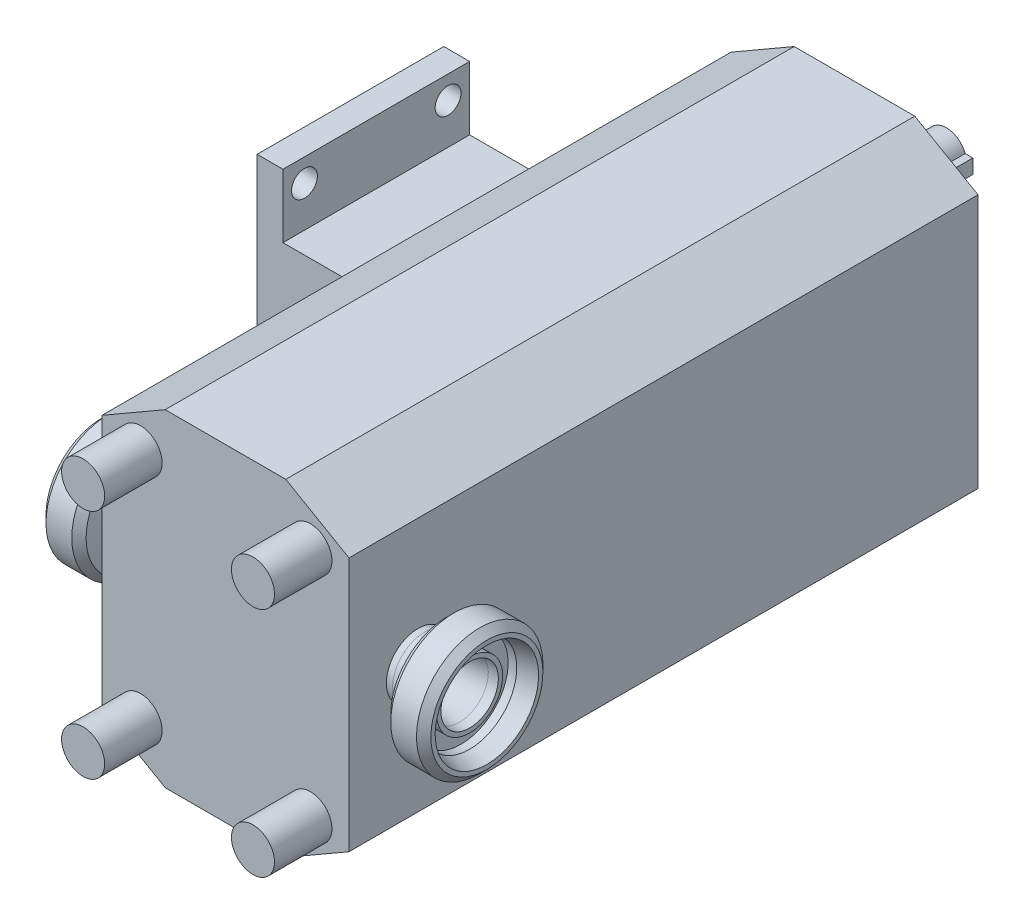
ISO-10303-21;
HEADER;
FILE_DESCRIPTION(('STEP AP214'),'2;1');
FILE_NAME('part.step','',(''),(''),'','','');
FILE_SCHEMA(('AUTOMOTIVE_DESIGN { 1 0 10303 214 1 1 1 1 }'));
ENDSEC;
DATA;
#1=APPLICATION_CONTEXT('core data for automotive mechanical design processes');
#2=APPLICATION_PROTOCOL_DEFINITION('international standard','automotive_design',2000,#1);
#3=PRODUCT_CONTEXT('',#1,'mechanical');
#4=PRODUCT('Part','Part','',(#3));
#5=PRODUCT_RELATED_PRODUCT_CATEGORY('part','',(#4));
#6=PRODUCT_DEFINITION_FORMATION('','',#4);
#7=PRODUCT_DEFINITION_CONTEXT('part definition',#1,'design');
#8=PRODUCT_DEFINITION('design','',#6,#7);
#9=PRODUCT_DEFINITION_SHAPE('','',#8);
#10=(LENGTH_UNIT() NAMED_UNIT(*) SI_UNIT(.MILLI.,.METRE.));
#11=(NAMED_UNIT(*) PLANE_ANGLE_UNIT() SI_UNIT($,.RADIAN.));
#12=(NAMED_UNIT(*) SI_UNIT($,.STERADIAN.) SOLID_ANGLE_UNIT());
#13=UNCERTAINTY_MEASURE_WITH_UNIT(LENGTH_MEASURE(1.E-05),#10,'distance_accuracy_value','');
#14=(GEOMETRIC_REPRESENTATION_CONTEXT(3) GLOBAL_UNCERTAINTY_ASSIGNED_CONTEXT((#13)) GLOBAL_UNIT_ASSIGNED_CONTEXT((#10,
#11,#12)) REPRESENTATION_CONTEXT('',''));
#15=CARTESIAN_POINT('',(0.,0.,0.));
#16=DIRECTION('',(0.,0.,1.));
#17=DIRECTION('',(1.,0.,0.));
#18=AXIS2_PLACEMENT_3D('',#15,#16,#17);
#19=CARTESIAN_POINT('',(58.,3.56186393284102,184.065507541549));
#20=DIRECTION('',(1.,0.,0.));
#21=DIRECTION('',(0.,-0.950825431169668,-0.30972729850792));
#22=AXIS2_PLACEMENT_3D('',#19,#20,#21);
#23=PLANE('',#22);
#24=CARTESIAN_POINT('',(58.,0.,195.));
#25=DIRECTION('',(-1.,0.,0.));
#26=DIRECTION('',(0.,0.950825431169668,0.30972729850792));
#27=AXIS2_PLACEMENT_3D('',#24,#25,#26);
#28=CIRCLE('',#27,11.5);
#29=CARTESIAN_POINT('',(58.,10.9344924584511,198.561863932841));
#30=VERTEX_POINT('',#29);
#31=EDGE_CURVE('P0_E69',#30,#30,#28,.T.);
#32=ORIENTED_EDGE('',*,*,#31,.T.);
#33=EDGE_LOOP('',(#32));
#34=FACE_BOUND('',#33,.T.);
#35=CARTESIAN_POINT('',(58.,0.,195.));
#36=DIRECTION('',(-1.,0.,0.));
#37=DIRECTION('',(0.,0.950825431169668,0.30972729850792));
#38=AXIS2_PLACEMENT_3D('',#35,#36,#37);
#39=CIRCLE('',#38,16.4);
#40=CARTESIAN_POINT('',(58.,15.5935370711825,200.07952769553));
#41=VERTEX_POINT('',#40);
#42=EDGE_CURVE('P0_E9',#41,#41,#39,.T.);
#43=ORIENTED_EDGE('',*,*,#42,.F.);
#44=EDGE_LOOP('',(#43));
#45=FACE_BOUND('',#44,.T.);
#46=ADVANCED_FACE('P0_F14',(#34,#45),#23,.T.);
#47=CARTESIAN_POINT('',(43.,0.,195.));
#48=DIRECTION('',(-1.,0.,0.));
#49=DIRECTION('',(0.,0.950825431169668,0.30972729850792));
#50=AXIS2_PLACEMENT_3D('',#47,#48,#49);
#51=CYLINDRICAL_SURFACE('',#50,16.4);
#52=ORIENTED_EDGE('',*,*,#42,.T.);
#53=EDGE_LOOP('',(#52));
#54=FACE_BOUND('',#53,.T.);
#55=CARTESIAN_POINT('',(61.,0.,195.));
#56=DIRECTION('',(-1.,0.,0.));
#57=DIRECTION('',(0.,0.950825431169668,0.30972729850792));
#58=AXIS2_PLACEMENT_3D('',#55,#56,#57);
#59=CIRCLE('',#58,16.4);
#60=CARTESIAN_POINT('',(61.,15.5935370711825,200.07952769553));
#61=VERTEX_POINT('',#60);
#62=EDGE_CURVE('P0_E20',#61,#61,#59,.T.);
#63=ORIENTED_EDGE('',*,*,#62,.F.);
#64=EDGE_LOOP('',(#63));
#65=FACE_BOUND('',#64,.T.);
#66=ADVANCED_FACE('P0_F88',(#54,#65),#51,.F.);
#67=CARTESIAN_POINT('',(67.,0.,195.));
#68=DIRECTION('',(1.,0.,0.));
#69=DIRECTION('',(0.,-0.950825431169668,-0.30972729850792));
#70=AXIS2_PLACEMENT_3D('',#67,#68,#69);
#71=CONICAL_SURFACE('',#70,18.0076951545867,0.26179938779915);
#72=ORIENTED_EDGE('',*,*,#62,.T.);
#73=EDGE_LOOP('',(#72));
#74=FACE_BOUND('',#73,.T.);
#75=CARTESIAN_POINT('',(67.,0.,195.));
#76=DIRECTION('',(-1.,0.,0.));
#77=DIRECTION('',(0.,0.950825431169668,0.30972729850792));
#78=AXIS2_PLACEMENT_3D('',#75,#76,#77);
#79=CIRCLE('',#78,18.0076951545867);
#80=CARTESIAN_POINT('',(67.,17.1221745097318,200.577474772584));
#81=VERTEX_POINT('',#80);
#82=EDGE_CURVE('P0_E24',#81,#81,#79,.T.);
#83=ORIENTED_EDGE('',*,*,#82,.F.);
#84=EDGE_LOOP('',(#83));
#85=FACE_BOUND('',#84,.T.);
#86=ADVANCED_FACE('P0_F92',(#74,#85),#71,.F.);
#87=CARTESIAN_POINT('',(67.,5.57747477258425,177.877825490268));
#88=DIRECTION('',(1.,0.,0.));
#89=DIRECTION('',(0.,-0.950825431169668,-0.30972729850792));
#90=AXIS2_PLACEMENT_3D('',#87,#88,#89);
#91=PLANE('',#90);
#92=ORIENTED_EDGE('',*,*,#82,.T.);
#93=EDGE_LOOP('',(#92));
#94=FACE_BOUND('',#93,.T.);
#95=CARTESIAN_POINT('',(67.,0.,195.));
#96=DIRECTION('',(-1.,0.,0.));
#97=DIRECTION('',(0.,0.950825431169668,0.30972729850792));
#98=AXIS2_PLACEMENT_3D('',#95,#96,#97);
#99=CIRCLE('',#98,19.5);
#100=CARTESIAN_POINT('',(67.,18.5410959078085,201.039682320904));
#101=VERTEX_POINT('',#100);
#102=EDGE_CURVE('P0_E28',#101,#101,#99,.T.);
#103=ORIENTED_EDGE('',*,*,#102,.F.);
#104=EDGE_LOOP('',(#103));
#105=FACE_BOUND('',#104,.T.);
#106=ADVANCED_FACE('P0_F96',(#94,#105),#91,.T.);
#107=CARTESIAN_POINT('',(64.5,0.,195.));
#108=DIRECTION('',(-1.,0.,0.));
#109=DIRECTION('',(0.,0.950825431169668,0.30972729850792));
#110=AXIS2_PLACEMENT_3D('',#107,#108,#109);
#111=CONICAL_SURFACE('',#110,22.,0.785398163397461);
#112=ORIENTED_EDGE('',*,*,#102,.T.);
#113=EDGE_LOOP('',(#112));
#114=FACE_BOUND('',#113,.T.);
#115=CARTESIAN_POINT('',(64.5,0.,195.));
#116=DIRECTION('',(-1.,0.,0.));
#117=DIRECTION('',(0.,0.950825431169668,0.30972729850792));
#118=AXIS2_PLACEMENT_3D('',#115,#116,#117);
#119=CIRCLE('',#118,22.);
#120=CARTESIAN_POINT('',(64.5,20.9181594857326,201.814000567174));
#121=VERTEX_POINT('',#120);
#122=EDGE_CURVE('P0_E33',#121,#121,#119,.T.);
#123=ORIENTED_EDGE('',*,*,#122,.F.);
#124=EDGE_LOOP('',(#123));
#125=FACE_BOUND('',#124,.T.);
#126=ADVANCED_FACE('P0_F102',(#114,#125),#111,.T.);
#127=CARTESIAN_POINT('',(43.,0.,195.));
#128=DIRECTION('',(-1.,0.,0.));
#129=DIRECTION('',(0.,0.950825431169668,0.30972729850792));
#130=AXIS2_PLACEMENT_3D('',#127,#128,#129);
#131=CYLINDRICAL_SURFACE('',#130,22.);
#132=ORIENTED_EDGE('',*,*,#122,.T.);
#133=EDGE_LOOP('',(#132));
#134=FACE_BOUND('',#133,.T.);
#135=CARTESIAN_POINT('',(55.5342888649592,0.,195.));
#136=DIRECTION('',(-1.,0.,0.));
#137=DIRECTION('',(0.,0.950825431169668,0.30972729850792));
#138=AXIS2_PLACEMENT_3D('',#135,#136,#137);
#139=CIRCLE('',#138,22.);
#140=CARTESIAN_POINT('',(55.5342888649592,20.9181594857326,201.814000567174));
#141=VERTEX_POINT('',#140);
#142=EDGE_CURVE('P0_E36',#141,#141,#139,.T.);
#143=ORIENTED_EDGE('',*,*,#142,.F.);
#144=EDGE_LOOP('',(#143));
#145=FACE_BOUND('',#144,.T.);
#146=ADVANCED_FACE('P0_F106',(#134,#145),#131,.T.);
#147=CARTESIAN_POINT('',(53.0342888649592,0.,195.));
#148=DIRECTION('',(1.,0.,0.));
#149=DIRECTION('',(0.,-0.950825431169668,-0.30972729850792));
#150=AXIS2_PLACEMENT_3D('',#147,#148,#149);
#151=CONICAL_SURFACE('',#150,19.5,0.785398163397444);
#152=ORIENTED_EDGE('',*,*,#142,.T.);
#153=EDGE_LOOP('',(#152));
#154=FACE_BOUND('',#153,.T.);
#155=CARTESIAN_POINT('',(53.0342888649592,0.,195.));
#156=DIRECTION('',(-1.,0.,0.));
#157=DIRECTION('',(0.,0.950825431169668,0.30972729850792));
#158=AXIS2_PLACEMENT_3D('',#155,#156,#157);
#159=CIRCLE('',#158,19.5);
#160=CARTESIAN_POINT('',(53.0342888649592,18.5410959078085,201.039682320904));
#161=VERTEX_POINT('',#160);
#162=EDGE_CURVE('P0_E39',#161,#161,#159,.T.);
#163=ORIENTED_EDGE('',*,*,#162,.F.);
#164=EDGE_LOOP('',(#163));
#165=FACE_BOUND('',#164,.T.);
#166=ADVANCED_FACE('P0_F110',(#154,#165),#151,.T.);
#167=CARTESIAN_POINT('',(52.0884056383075,0.,195.));
#168=DIRECTION('',(1.,0.,0.));
#169=DIRECTION('',(0.,-0.950825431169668,-0.30972729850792));
#170=AXIS2_PLACEMENT_3D('',#167,#168,#169);
#171=CONICAL_SURFACE('',#170,14.1356296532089,1.39626340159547);
#172=ORIENTED_EDGE('',*,*,#162,.T.);
#173=EDGE_LOOP('',(#172));
#174=FACE_BOUND('',#173,.T.);
#175=CARTESIAN_POINT('',(52.0884056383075,0.,195.));
#176=DIRECTION('',(-1.,0.,0.));
#177=DIRECTION('',(0.,0.950825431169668,0.30972729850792));
#178=AXIS2_PLACEMENT_3D('',#175,#176,#177);
#179=CIRCLE('',#178,14.1356296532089);
#180=CARTESIAN_POINT('',(52.0884056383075,13.4405161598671,199.378190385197));
#181=VERTEX_POINT('',#180);
#182=EDGE_CURVE('P0_E42',#181,#181,#179,.T.);
#183=ORIENTED_EDGE('',*,*,#182,.F.);
#184=EDGE_LOOP('',(#183));
#185=FACE_BOUND('',#184,.T.);
#186=ADVANCED_FACE('P0_F114',(#174,#185),#171,.T.);
#187=CARTESIAN_POINT('',(49.626386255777,0.,195.));
#188=DIRECTION('',(-1.,0.,0.));
#189=DIRECTION('',(0.,0.950825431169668,0.30972729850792));
#190=AXIS2_PLACEMENT_3D('',#187,#188,#189);
#191=TOROIDAL_SURFACE('',#190,14.5697500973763,2.5);
#192=ORIENTED_EDGE('',*,*,#182,.T.);
#193=EDGE_LOOP('',(#192));
#194=FACE_BOUND('',#193,.T.);
#195=CARTESIAN_POINT('',(50.1804390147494,0.,195.));
#196=DIRECTION('',(-1.,0.,0.));
#197=DIRECTION('',(0.,0.950825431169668,0.30972729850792));
#198=AXIS2_PLACEMENT_3D('',#195,#196,#197);
#199=CIRCLE('',#198,12.1319179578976);
#200=CARTESIAN_POINT('',(50.1804390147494,11.535336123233,198.757586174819));
#201=VERTEX_POINT('',#200);
#202=EDGE_CURVE('P0_E45',#201,#201,#199,.T.);
#203=ORIENTED_EDGE('',*,*,#202,.F.);
#204=EDGE_LOOP('',(#203));
#205=FACE_BOUND('',#204,.T.);
#206=ADVANCED_FACE('P0_F118',(#194,#205),#191,.F.);
#207=CARTESIAN_POINT('',(45.2,0.,195.));
#208=DIRECTION('',(1.,0.,0.));
#209=DIRECTION('',(0.,-0.950825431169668,-0.30972729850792));
#210=AXIS2_PLACEMENT_3D('',#207,#208,#209);
#211=CONICAL_SURFACE('',#210,11.,0.223476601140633);
#212=ORIENTED_EDGE('',*,*,#202,.T.);
#213=EDGE_LOOP('',(#212));
#214=FACE_BOUND('',#213,.T.);
#215=CARTESIAN_POINT('',(45.2,0.,195.));
#216=DIRECTION('',(-1.,0.,0.));
#217=DIRECTION('',(0.,0.950825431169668,0.30972729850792));
#218=AXIS2_PLACEMENT_3D('',#215,#216,#217);
#219=CIRCLE('',#218,11.);
#220=CARTESIAN_POINT('',(45.2,10.4590797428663,198.407000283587));
#221=VERTEX_POINT('',#220);
#222=EDGE_CURVE('P0_E48',#221,#221,#219,.T.);
#223=ORIENTED_EDGE('',*,*,#222,.F.);
#224=EDGE_LOOP('',(#223));
#225=FACE_BOUND('',#224,.T.);
#226=ADVANCED_FACE('P0_F122',(#214,#225),#211,.T.);
#227=CARTESIAN_POINT('',(43.,0.,195.));
#228=DIRECTION('',(-1.,0.,0.));
#229=DIRECTION('',(0.,0.950825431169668,0.30972729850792));
#230=AXIS2_PLACEMENT_3D('',#227,#228,#229);
#231=CYLINDRICAL_SURFACE('',#230,11.);
#232=ORIENTED_EDGE('',*,*,#222,.T.);
#233=EDGE_LOOP('',(#232));
#234=FACE_BOUND('',#233,.T.);
#235=CARTESIAN_POINT('',(43.,0.,195.));
#236=DIRECTION('',(-1.,0.,0.));
#237=DIRECTION('',(0.,0.950825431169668,0.30972729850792));
#238=AXIS2_PLACEMENT_3D('',#235,#236,#237);
#239=CIRCLE('',#238,11.);
#240=CARTESIAN_POINT('',(43.,10.4590797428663,198.407000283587));
#241=VERTEX_POINT('',#240);
#242=EDGE_CURVE('P0_E51',#241,#241,#239,.T.);
#243=ORIENTED_EDGE('',*,*,#242,.F.);
#244=EDGE_LOOP('',(#243));
#245=FACE_BOUND('',#244,.T.);
#246=ADVANCED_FACE('P0_F126',(#234,#245),#231,.T.);
#247=CARTESIAN_POINT('',(43.,2.4778183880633,187.393396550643));
#248=DIRECTION('',(-1.,0.,0.));
#249=DIRECTION('',(0.,0.950825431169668,0.30972729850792));
#250=AXIS2_PLACEMENT_3D('',#247,#248,#249);
#251=PLANE('',#250);
#252=ORIENTED_EDGE('',*,*,#242,.T.);
#253=EDGE_LOOP('',(#252));
#254=FACE_BOUND('',#253,.T.);
#255=CARTESIAN_POINT('',(43.,0.,195.));
#256=DIRECTION('',(-1.,0.,0.));
#257=DIRECTION('',(0.,0.950825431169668,0.30972729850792));
#258=AXIS2_PLACEMENT_3D('',#255,#256,#257);
#259=CIRCLE('',#258,8.);
#260=CARTESIAN_POINT('',(43.,7.60660344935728,197.477818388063));
#261=VERTEX_POINT('',#260);
#262=EDGE_CURVE('P0_E54',#261,#261,#259,.T.);
#263=ORIENTED_EDGE('',*,*,#262,.F.);
#264=EDGE_LOOP('',(#263));
#265=FACE_BOUND('',#264,.T.);
#266=ADVANCED_FACE('P0_F130',(#254,#265),#251,.T.);
#267=CARTESIAN_POINT('',(43.,0.,195.));
#268=DIRECTION('',(-1.,0.,0.));
#269=DIRECTION('',(0.,0.950825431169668,0.30972729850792));
#270=AXIS2_PLACEMENT_3D('',#267,#268,#269);
#271=CYLINDRICAL_SURFACE('',#270,8.);
#272=ORIENTED_EDGE('',*,*,#262,.T.);
#273=EDGE_LOOP('',(#272));
#274=FACE_BOUND('',#273,.T.);
#275=CARTESIAN_POINT('',(46.1574363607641,0.,195.));
#276=DIRECTION('',(-1.,0.,0.));
#277=DIRECTION('',(0.,0.950825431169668,0.30972729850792));
#278=AXIS2_PLACEMENT_3D('',#275,#276,#277);
#279=CIRCLE('',#278,8.);
#280=CARTESIAN_POINT('',(46.1574363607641,7.60660344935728,197.477818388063));
#281=VERTEX_POINT('',#280);
#282=EDGE_CURVE('P0_E57',#281,#281,#279,.T.);
#283=ORIENTED_EDGE('',*,*,#282,.F.);
#284=EDGE_LOOP('',(#283));
#285=FACE_BOUND('',#284,.T.);
#286=ADVANCED_FACE('P0_F134',(#274,#285),#271,.F.);
#287=CARTESIAN_POINT('',(57.5,0.,195.));
#288=DIRECTION('',(1.,0.,0.));
#289=DIRECTION('',(0.,-0.950825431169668,-0.30972729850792));
#290=AXIS2_PLACEMENT_3D('',#287,#288,#289);
#291=CONICAL_SURFACE('',#290,10.,0.174532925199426);
#292=ORIENTED_EDGE('',*,*,#282,.T.);
#293=EDGE_LOOP('',(#292));
#294=FACE_BOUND('',#293,.T.);
#295=CARTESIAN_POINT('',(57.5,0.,195.));
#296=DIRECTION('',(-1.,0.,0.));
#297=DIRECTION('',(0.,0.950825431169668,0.30972729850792));
#298=AXIS2_PLACEMENT_3D('',#295,#296,#297);
#299=CIRCLE('',#298,10.);
#300=CARTESIAN_POINT('',(57.5,9.50825431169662,198.097272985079));
#301=VERTEX_POINT('',#300);
#302=EDGE_CURVE('P0_E60',#301,#301,#299,.T.);
#303=ORIENTED_EDGE('',*,*,#302,.F.);
#304=EDGE_LOOP('',(#303));
#305=FACE_BOUND('',#304,.T.);
#306=ADVANCED_FACE('P0_F138',(#294,#305),#291,.F.);
#307=CARTESIAN_POINT('',(43.,0.,195.));
#308=DIRECTION('',(-1.,0.,0.));
#309=DIRECTION('',(0.,0.950825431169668,0.30972729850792));
#310=AXIS2_PLACEMENT_3D('',#307,#308,#309);
#311=CYLINDRICAL_SURFACE('',#310,10.);
#312=ORIENTED_EDGE('',*,*,#302,.T.);
#313=EDGE_LOOP('',(#312));
#314=FACE_BOUND('',#313,.T.);
#315=CARTESIAN_POINT('',(61.,0.,195.));
#316=DIRECTION('',(-1.,0.,0.));
#317=DIRECTION('',(0.,0.950825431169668,0.30972729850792));
#318=AXIS2_PLACEMENT_3D('',#315,#316,#317);
#319=CIRCLE('',#318,10.);
#320=CARTESIAN_POINT('',(61.,9.50825431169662,198.097272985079));
#321=VERTEX_POINT('',#320);
#322=EDGE_CURVE('P0_E63',#321,#321,#319,.T.);
#323=ORIENTED_EDGE('',*,*,#322,.F.);
#324=EDGE_LOOP('',(#323));
#325=FACE_BOUND('',#324,.T.);
#326=ADVANCED_FACE('P0_F84',(#314,#325),#311,.F.);
#327=CARTESIAN_POINT('',(61.,3.09727298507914,185.491745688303));
#328=DIRECTION('',(1.,0.,0.));
#329=DIRECTION('',(0.,-0.950825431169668,-0.30972729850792));
#330=AXIS2_PLACEMENT_3D('',#327,#328,#329);
#331=PLANE('',#330);
#332=ORIENTED_EDGE('',*,*,#322,.T.);
#333=EDGE_LOOP('',(#332));
#334=FACE_BOUND('',#333,.T.);
#335=CARTESIAN_POINT('',(61.,0.,195.));
#336=DIRECTION('',(-1.,0.,0.));
#337=DIRECTION('',(0.,0.950825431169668,0.30972729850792));
#338=AXIS2_PLACEMENT_3D('',#335,#336,#337);
#339=CIRCLE('',#338,11.5);
#340=CARTESIAN_POINT('',(61.,10.9344924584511,198.561863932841));
#341=VERTEX_POINT('',#340);
#342=EDGE_CURVE('P0_E66',#341,#341,#339,.T.);
#343=ORIENTED_EDGE('',*,*,#342,.F.);
#344=EDGE_LOOP('',(#343));
#345=FACE_BOUND('',#344,.T.);
#346=ADVANCED_FACE('P0_F77',(#334,#345),#331,.T.);
#347=CARTESIAN_POINT('',(43.,0.,195.));
#348=DIRECTION('',(-1.,0.,0.));
#349=DIRECTION('',(0.,0.950825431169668,0.30972729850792));
#350=AXIS2_PLACEMENT_3D('',#347,#348,#349);
#351=CYLINDRICAL_SURFACE('',#350,11.5);
#352=ORIENTED_EDGE('',*,*,#342,.T.);
#353=EDGE_LOOP('',(#352));
#354=FACE_BOUND('',#353,.T.);
#355=ORIENTED_EDGE('',*,*,#31,.F.);
#356=EDGE_LOOP('',(#355));
#357=FACE_BOUND('',#356,.T.);
#358=ADVANCED_FACE('P0_F75',(#354,#357),#351,.T.);
#359=CLOSED_SHELL('',(#46,#66,#86,#106,#126,#146,#166,#186,#206,#226,#246,#266,#286,#306,#326,
#346,#358));
#360=MANIFOLD_SOLID_BREP('P0_B1',#359);
#361=CARTESIAN_POINT('',(-43.,-44.2982940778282,219.));
#362=DIRECTION('',(1.,0.,0.));
#363=DIRECTION('',(0.,0.,-1.));
#364=AXIS2_PLACEMENT_3D('',#361,#362,#363);
#365=PLANE('',#364);
#366=DIRECTION('',(0.,-1.,0.));
#367=VECTOR('',#366,1.);
#368=CARTESIAN_POINT('',(-43.,-44.2982940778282,0.));
#369=LINE('',#368,#367);
#370=CARTESIAN_POINT('',(-43.,44.2982940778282,0.));
#371=VERTEX_POINT('',#370);
#372=CARTESIAN_POINT('',(-43.,-44.2982940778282,0.));
#373=VERTEX_POINT('',#372);
#374=EDGE_CURVE('P1_E290',#371,#373,#369,.T.);
#375=ORIENTED_EDGE('',*,*,#374,.T.);
#376=DIRECTION('',(0.,0.,-1.));
#377=VECTOR('',#376,1.);
#378=CARTESIAN_POINT('',(-43.,-44.2982940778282,219.));
#379=LINE('',#378,#377);
#380=CARTESIAN_POINT('',(-43.,-44.2982940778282,219.));
#381=VERTEX_POINT('',#380);
#382=EDGE_CURVE('P1_E320',#381,#373,#379,.T.);
#383=ORIENTED_EDGE('',*,*,#382,.F.);
#384=DIRECTION('',(0.,-1.,0.));
#385=VECTOR('',#384,1.);
#386=CARTESIAN_POINT('',(-43.,-44.2982940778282,219.));
#387=LINE('',#386,#385);
#388=CARTESIAN_POINT('',(-43.,44.2982940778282,219.));
#389=VERTEX_POINT('',#388);
#390=EDGE_CURVE('P1_E272',#389,#381,#387,.T.);
#391=ORIENTED_EDGE('',*,*,#390,.F.);
#392=DIRECTION('',(0.,0.,-1.));
#393=VECTOR('',#392,1.);
#394=CARTESIAN_POINT('',(-43.,44.2982940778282,219.));
#395=LINE('',#394,#393);
#396=EDGE_CURVE('P1_E323',#389,#371,#395,.T.);
#397=ORIENTED_EDGE('',*,*,#396,.T.);
#398=EDGE_LOOP('',(#375,#383,#391,#397));
#399=FACE_BOUND('',#398,.T.);
#400=CARTESIAN_POINT('',(-43.,0.,195.));
#401=DIRECTION('',(1.,0.,0.));
#402=DIRECTION('',(0.,1.,0.));
#403=AXIS2_PLACEMENT_3D('',#400,#401,#402);
#404=CIRCLE('',#403,8.00000000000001);
#405=CARTESIAN_POINT('',(-43.,8.00000000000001,195.));
#406=VERTEX_POINT('',#405);
#407=EDGE_CURVE('P1_E214',#406,#406,#404,.T.);
#408=ORIENTED_EDGE('',*,*,#407,.T.);
#409=EDGE_LOOP('',(#408));
#410=FACE_BOUND('',#409,.T.);
#411=DIRECTION('',(0.,-1.,0.));
#412=VECTOR('',#411,1.);
#413=CARTESIAN_POINT('',(-43.,-44.2982940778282,63.));
#414=LINE('',#413,#412);
#415=CARTESIAN_POINT('',(-43.,36.8601182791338,63.));
#416=VERTEX_POINT('',#415);
#417=CARTESIAN_POINT('',(-43.,-36.8601182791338,63.));
#418=VERTEX_POINT('',#417);
#419=EDGE_CURVE('P1_E11',#416,#418,#414,.T.);
#420=ORIENTED_EDGE('',*,*,#419,.F.);
#421=DIRECTION('',(0.,0.,-1.));
#422=VECTOR('',#421,1.);
#423=CARTESIAN_POINT('',(-43.,36.8601182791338,219.));
#424=LINE('',#423,#422);
#425=CARTESIAN_POINT('',(-43.,36.8601182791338,128.));
#426=VERTEX_POINT('',#425);
#427=EDGE_CURVE('P1_E570',#426,#416,#424,.T.);
#428=ORIENTED_EDGE('',*,*,#427,.F.);
#429=DIRECTION('',(0.,-1.,0.));
#430=VECTOR('',#429,1.);
#431=CARTESIAN_POINT('',(-43.,-44.2982940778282,128.));
#432=LINE('',#431,#430);
#433=CARTESIAN_POINT('',(-43.,-36.8601182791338,128.));
#434=VERTEX_POINT('',#433);
#435=EDGE_CURVE('P1_E343',#426,#434,#432,.T.);
#436=ORIENTED_EDGE('',*,*,#435,.T.);
#437=DIRECTION('',(0.,0.,1.));
#438=VECTOR('',#437,1.);
#439=CARTESIAN_POINT('',(-43.,-36.8601182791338,219.));
#440=LINE('',#439,#438);
#441=EDGE_CURVE('P1_E25',#418,#434,#440,.T.);
#442=ORIENTED_EDGE('',*,*,#441,.F.);
#443=EDGE_LOOP('',(#420,#428,#436,#442));
#444=FACE_BOUND('',#443,.T.);
#445=ADVANCED_FACE('P1_F17',(#399,#410,#444),#365,.F.);
#446=CARTESIAN_POINT('',(0.,20.,219.362441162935));
#447=DIRECTION('',(0.,0.,1.));
#448=DIRECTION('',(1.,0.,0.));
#449=AXIS2_PLACEMENT_3D('',#446,#447,#448);
#450=CYLINDRICAL_SURFACE('',#449,7.);
#451=CARTESIAN_POINT('',(0.,20.,-2.));
#452=DIRECTION('',(0.,0.,1.));
#453=DIRECTION('',(1.,0.,0.));
#454=AXIS2_PLACEMENT_3D('',#451,#452,#453);
#455=CIRCLE('',#454,7.);
#456=CARTESIAN_POINT('',(7.,20.,-2.));
#457=VERTEX_POINT('',#456);
#458=EDGE_CURVE('P1_E247',#457,#457,#455,.T.);
#459=ORIENTED_EDGE('',*,*,#458,.F.);
#460=EDGE_LOOP('',(#459));
#461=FACE_BOUND('',#460,.T.);
#462=DIRECTION('',(0.,0.,1.));
#463=VECTOR('',#462,1.);
#464=CARTESIAN_POINT('',(6.53834841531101,22.5,219.362441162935));
#465=LINE('',#464,#463);
#466=CARTESIAN_POINT('',(6.53834841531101,22.5,-32.));
#467=VERTEX_POINT('',#466);
#468=CARTESIAN_POINT('',(6.53834841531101,22.5,-17.));
#469=VERTEX_POINT('',#468);
#470=EDGE_CURVE('P1_E243',#467,#469,#465,.T.);
#471=ORIENTED_EDGE('',*,*,#470,.F.);
#472=CARTESIAN_POINT('',(0.,20.,-32.));
#473=DIRECTION('',(0.,0.,1.));
#474=DIRECTION('',(1.,0.,0.));
#475=AXIS2_PLACEMENT_3D('',#472,#473,#474);
#476=CIRCLE('',#475,7.);
#477=CARTESIAN_POINT('',(6.53834841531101,17.5,-32.));
#478=VERTEX_POINT('',#477);
#479=EDGE_CURVE('P1_E245',#467,#478,#476,.T.);
#480=ORIENTED_EDGE('',*,*,#479,.T.);
#481=DIRECTION('',(0.,0.,1.));
#482=VECTOR('',#481,1.);
#483=CARTESIAN_POINT('',(6.53834841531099,17.4999999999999,219.362441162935));
#484=LINE('',#483,#482);
#485=CARTESIAN_POINT('',(6.53834841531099,17.4999999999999,-17.));
#486=VERTEX_POINT('',#485);
#487=EDGE_CURVE('P1_E240',#486,#478,#484,.F.);
#488=ORIENTED_EDGE('',*,*,#487,.F.);
#489=CARTESIAN_POINT('',(7.,20.,-19.5));
#490=CARTESIAN_POINT('',(7.0000020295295,20.1358397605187,-19.5000028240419));
#491=CARTESIAN_POINT('',(6.99601056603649,20.2716594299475,-19.4888932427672));
#492=CARTESIAN_POINT('',(6.98048404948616,20.5392648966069,-19.444908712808));
#493=CARTESIAN_POINT('',(6.96894928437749,20.6710508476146,-19.4120345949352));
#494=CARTESIAN_POINT('',(6.93958109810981,20.9266921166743,-19.3258148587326));
#495=CARTESIAN_POINT('',(6.92175912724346,21.0505613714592,-19.2725064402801));
#496=CARTESIAN_POINT('',(6.88161078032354,21.287595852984,-19.1471112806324));
#497=CARTESIAN_POINT('',(6.85928332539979,21.4007585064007,-19.075020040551));
#498=CARTESIAN_POINT('',(6.81147377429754,21.6175880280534,-18.9111568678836));
#499=CARTESIAN_POINT('',(6.78590827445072,21.7207801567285,-18.8187812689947));
#500=CARTESIAN_POINT('',(6.73493522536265,21.9105819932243,-18.6182536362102));
#501=CARTESIAN_POINT('',(6.70952771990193,21.9971872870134,-18.5100974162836));
#502=CARTESIAN_POINT('',(6.6608007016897,22.1542373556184,-18.2766022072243));
#503=CARTESIAN_POINT('',(6.63758107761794,22.2240352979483,-18.1508052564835));
#504=CARTESIAN_POINT('',(6.59714352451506,22.3412757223,-17.8882963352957));
#505=CARTESIAN_POINT('',(6.57992345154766,22.3887261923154,-17.7515882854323));
#506=CARTESIAN_POINT('',(6.55432038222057,22.4580913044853,-17.4765771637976));
#507=CARTESIAN_POINT('',(6.54562733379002,22.4809051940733,-17.3385306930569));
#508=CARTESIAN_POINT('',(6.53715061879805,22.5031615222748,-17.0603163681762));
#509=CARTESIAN_POINT('',(6.53736369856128,22.5026124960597,-16.9201493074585));
#510=CARTESIAN_POINT('',(6.54640588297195,22.4788507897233,-16.6496443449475));
#511=CARTESIAN_POINT('',(6.55477363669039,22.4568516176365,-16.5191816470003));
#512=CARTESIAN_POINT('',(6.57842082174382,22.3928085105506,-16.2639384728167));
#513=CARTESIAN_POINT('',(6.59370119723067,22.3507618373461,-16.1391587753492));
#514=CARTESIAN_POINT('',(6.62975170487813,22.247095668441,-15.8962262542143));
#515=CARTESIAN_POINT('',(6.65061447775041,22.1851419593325,-15.7782303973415));
#516=CARTESIAN_POINT('',(6.69544469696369,22.0436527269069,-15.5539436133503));
#517=CARTESIAN_POINT('',(6.71941314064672,21.9641115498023,-15.4476564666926));
#518=CARTESIAN_POINT('',(6.76952498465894,21.784031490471,-15.2430404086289));
#519=CARTESIAN_POINT('',(6.7957122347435,21.6825133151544,-15.1455821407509));
#520=CARTESIAN_POINT('',(6.84605473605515,21.4642618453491,-14.9688283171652));
#521=CARTESIAN_POINT('',(6.87020973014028,21.3475266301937,-14.8895350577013));
#522=CARTESIAN_POINT('',(6.91416998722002,21.1001003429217,-14.7505193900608));
#523=CARTESIAN_POINT('',(6.93391532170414,20.9692491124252,-14.6910617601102));
#524=CARTESIAN_POINT('',(6.96639167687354,20.6985234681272,-14.5952841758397));
#525=CARTESIAN_POINT('',(6.97912551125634,20.5586526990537,-14.5589549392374));
#526=CARTESIAN_POINT('',(6.99566202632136,20.2812050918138,-14.5120808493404));
#527=CARTESIAN_POINT('',(6.99987103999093,20.1438506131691,-14.5003618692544));
#528=CARTESIAN_POINT('',(7.00012297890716,19.8690906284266,-14.4996548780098));
#529=CARTESIAN_POINT('',(6.99616751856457,19.7316851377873,-14.5106623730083));
#530=CARTESIAN_POINT('',(6.98080349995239,19.4656313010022,-14.5541861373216));
#531=CARTESIAN_POINT('',(6.96965417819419,19.3368441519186,-14.5859547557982));
#532=CARTESIAN_POINT('',(6.94128245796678,19.08650055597,-14.6691365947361));
#533=CARTESIAN_POINT('',(6.9240592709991,18.9649450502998,-14.7205523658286));
#534=CARTESIAN_POINT('',(6.88465739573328,18.728682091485,-14.8431588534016));
#535=CARTESIAN_POINT('',(6.86235262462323,18.6142645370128,-14.9148664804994));
#536=CARTESIAN_POINT('',(6.81528395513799,18.3987206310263,-15.0754274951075));
#537=CARTESIAN_POINT('',(6.79051921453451,18.2975988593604,-15.1642867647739));
#538=CARTESIAN_POINT('',(6.73966040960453,18.1059770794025,-15.3621296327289));
#539=CARTESIAN_POINT('',(6.71356479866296,18.0163131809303,-15.4719247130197));
#540=CARTESIAN_POINT('',(6.66427875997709,17.856544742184,-15.7055412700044));
#541=CARTESIAN_POINT('',(6.64108847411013,17.7864411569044,-15.8293634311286));
#542=CARTESIAN_POINT('',(6.60040332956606,17.6679131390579,-16.0880648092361));
#543=CARTESIAN_POINT('',(6.58291456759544,17.6195118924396,-16.2229556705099));
#544=CARTESIAN_POINT('',(6.55601442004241,17.5463858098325,-16.4997601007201));
#545=CARTESIAN_POINT('',(6.54659865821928,17.5216481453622,-16.6416698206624));
#546=CARTESIAN_POINT('',(6.53745596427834,17.4976374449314,-16.919520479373));
#547=CARTESIAN_POINT('',(6.53719306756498,17.4969557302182,-17.0553232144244));
#548=CARTESIAN_POINT('',(6.54503319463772,17.5175296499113,-17.3249976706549));
#549=CARTESIAN_POINT('',(6.55313556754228,17.5387835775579,-17.4588695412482));
#550=CARTESIAN_POINT('',(6.57636700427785,17.601569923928,-17.7175005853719));
#551=CARTESIAN_POINT('',(6.59131474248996,17.6425803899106,-17.8424040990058));
#552=CARTESIAN_POINT('',(6.62646329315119,17.7432735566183,-18.0836426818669));
#553=CARTESIAN_POINT('',(6.64666536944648,17.802960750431,-18.1999756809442));
#554=CARTESIAN_POINT('',(6.69127230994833,17.9426968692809,-18.4269257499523));
#555=CARTESIAN_POINT('',(6.71583400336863,18.0235962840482,-18.5369880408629));
#556=CARTESIAN_POINT('',(6.76580411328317,18.2020913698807,-18.7424275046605));
#557=CARTESIAN_POINT('',(6.79121278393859,18.2996920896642,-18.837800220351));
#558=CARTESIAN_POINT('',(6.84145445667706,18.5143374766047,-19.0157219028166));
#559=CARTESIAN_POINT('',(6.86620367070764,18.6320824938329,-19.0974530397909));
#560=CARTESIAN_POINT('',(6.91104924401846,18.8804886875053,-19.2399076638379));
#561=CARTESIAN_POINT('',(6.93114595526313,19.011148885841,-19.3006327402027));
#562=CARTESIAN_POINT('',(6.96446006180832,19.282353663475,-19.3991403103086));
#563=CARTESIAN_POINT('',(6.97764821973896,19.4229374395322,-19.4368254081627));
#564=CARTESIAN_POINT('',(6.99541542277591,19.7090231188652,-19.4872488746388));
#565=CARTESIAN_POINT('',(6.99999782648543,19.8545230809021,-19.4999969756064));
#566=CARTESIAN_POINT('',(7.,20.,-19.5));
#567=B_SPLINE_CURVE_WITH_KNOTS('',3,(#489,#490,#491,#492,#493,#494,#495,#496,#497,#498,#499,
#500,#501,#502,#503,#504,#505,#506,#507,#508,#509,#510,#511,#512,#513,#514,#515,#516,#517,#518,
#519,#520,#521,#522,#523,#524,#525,#526,#527,#528,#529,#530,#531,#532,#533,#534,#535,#536,#537,
#538,#539,#540,#541,#542,#543,#544,#545,#546,#547,#548,#549,#550,#551,#552,#553,#554,#555,#556,
#557,#558,#559,#560,#561,#562,#563,#564,#565,#566),.UNSPECIFIED.,.T.,.F.,(4,2,2,2,2,2,2,2,2,2,2,
2,2,2,2,2,2,2,2,2,2,2,2,2,2,2,2,2,2,2,2,2,2,2,2,2,2,2,4),(0.,0.406983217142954,
0.813950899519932,1.22018120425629,1.62650889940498,2.04714572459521,2.46789433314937,
2.90289606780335,3.3377421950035,3.75611562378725,4.17433620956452,4.57019246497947,
4.96610280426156,5.36904149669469,5.77210990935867,6.19956653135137,6.62707715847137,
7.06008524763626,7.49291944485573,7.90458529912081,8.31616976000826,8.71369326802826,
9.11126840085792,9.52005856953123,9.92898918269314,10.3593838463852,10.7897995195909,
11.2206739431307,11.6513146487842,12.0566930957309,12.4620400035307,12.8572208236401,
13.2524967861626,13.6670344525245,14.0816976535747,14.5159343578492,14.9501382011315,
15.3861650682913,15.8220217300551),.UNSPECIFIED.);
#568=EDGE_CURVE('P1_E40',#469,#486,#567,.T.);
#569=ORIENTED_EDGE('',*,*,#568,.F.);
#570=EDGE_LOOP('',(#471,#480,#488,#569));
#571=FACE_BOUND('',#570,.T.);
#572=ADVANCED_FACE('P1_F345',(#461,#571),#450,.T.);
#573=CARTESIAN_POINT('',(-119.726896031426,0.,0.));
#574=DIRECTION('',(0.,0.,-1.));
#575=DIRECTION('',(-1.,0.,0.));
#576=AXIS2_PLACEMENT_3D('',#573,#574,#575);
#577=PLANE('',#576);
#578=DIRECTION('',(-0.866025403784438,-0.500000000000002,0.));
#579=VECTOR('',#578,1.);
#580=CARTESIAN_POINT('',(-43.,44.2982940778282,0.));
#581=LINE('',#580,#579);
#582=CARTESIAN_POINT('',(-21.,57.,0.));
#583=VERTEX_POINT('',#582);
#584=EDGE_CURVE('P1_E268',#583,#371,#581,.T.);
#585=ORIENTED_EDGE('',*,*,#584,.F.);
#586=DIRECTION('',(-1.,0.,0.));
#587=VECTOR('',#586,1.);
#588=CARTESIAN_POINT('',(-21.,57.,0.));
#589=LINE('',#588,#587);
#590=CARTESIAN_POINT('',(21.,57.,0.));
#591=VERTEX_POINT('',#590);
#592=EDGE_CURVE('P1_E273',#591,#583,#589,.T.);
#593=ORIENTED_EDGE('',*,*,#592,.F.);
#594=DIRECTION('',(-0.866025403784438,0.500000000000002,0.));
#595=VECTOR('',#594,1.);
#596=CARTESIAN_POINT('',(21.,57.,0.));
#597=LINE('',#596,#595);
#598=CARTESIAN_POINT('',(43.,44.2982940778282,0.));
#599=VERTEX_POINT('',#598);
#600=EDGE_CURVE('P1_E300',#599,#591,#597,.T.);
#601=ORIENTED_EDGE('',*,*,#600,.F.);
#602=DIRECTION('',(0.,1.,0.));
#603=VECTOR('',#602,1.);
#604=CARTESIAN_POINT('',(42.9999999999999,-44.2982940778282,0.));
#605=LINE('',#604,#603);
#606=CARTESIAN_POINT('',(42.9999999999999,-44.2982940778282,0.));
#607=VERTEX_POINT('',#606);
#608=EDGE_CURVE('P1_E298',#607,#599,#605,.T.);
#609=ORIENTED_EDGE('',*,*,#608,.F.);
#610=DIRECTION('',(0.866025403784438,0.500000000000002,0.));
#611=VECTOR('',#610,1.);
#612=CARTESIAN_POINT('',(20.9999999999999,-57.,0.));
#613=LINE('',#612,#611);
#614=CARTESIAN_POINT('',(20.9999999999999,-57.,0.));
#615=VERTEX_POINT('',#614);
#616=EDGE_CURVE('P1_E296',#615,#607,#613,.T.);
#617=ORIENTED_EDGE('',*,*,#616,.F.);
#618=DIRECTION('',(1.,0.,0.));
#619=VECTOR('',#618,1.);
#620=CARTESIAN_POINT('',(-21.,-57.,0.));
#621=LINE('',#620,#619);
#622=CARTESIAN_POINT('',(-21.,-57.,0.));
#623=VERTEX_POINT('',#622);
#624=EDGE_CURVE('P1_E294',#623,#615,#621,.T.);
#625=ORIENTED_EDGE('',*,*,#624,.F.);
#626=DIRECTION('',(0.866025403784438,-0.500000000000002,0.));
#627=VECTOR('',#626,1.);
#628=CARTESIAN_POINT('',(-43.,-44.2982940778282,0.));
#629=LINE('',#628,#627);
#630=EDGE_CURVE('P1_E292',#373,#623,#629,.T.);
#631=ORIENTED_EDGE('',*,*,#630,.F.);
#632=ORIENTED_EDGE('',*,*,#374,.F.);
#633=EDGE_LOOP('',(#585,#593,#601,#609,#617,#625,#631,#632));
#634=FACE_BOUND('',#633,.T.);
#635=CARTESIAN_POINT('',(0.,20.,0.));
#636=DIRECTION('',(0.,0.,1.));
#637=DIRECTION('',(1.,0.,0.));
#638=AXIS2_PLACEMENT_3D('',#635,#636,#637);
#639=CIRCLE('',#638,10.);
#640=CARTESIAN_POINT('',(10.,20.,0.));
#641=VERTEX_POINT('',#640);
#642=EDGE_CURVE('P1_E253',#641,#641,#639,.T.);
#643=ORIENTED_EDGE('',*,*,#642,.T.);
#644=EDGE_LOOP('',(#643));
#645=FACE_BOUND('',#644,.T.);
#646=ADVANCED_FACE('P1_F378',(#634,#645),#577,.T.);
#647=CARTESIAN_POINT('',(-119.726896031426,0.,219.));
#648=DIRECTION('',(0.,0.,-1.));
#649=DIRECTION('',(-1.,0.,0.));
#650=AXIS2_PLACEMENT_3D('',#647,#648,#649);
#651=PLANE('',#650);
#652=CARTESIAN_POINT('',(29.5708036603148,-40.3888822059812,219.));
#653=DIRECTION('',(0.,0.,-1.));
#654=DIRECTION('',(-1.,0.,0.));
#655=AXIS2_PLACEMENT_3D('',#652,#653,#654);
#656=CIRCLE('',#655,7.5);
#657=CARTESIAN_POINT('',(22.0708036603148,-40.3888822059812,219.));
#658=VERTEX_POINT('',#657);
#659=EDGE_CURVE('P1_E332',#658,#658,#656,.F.);
#660=ORIENTED_EDGE('',*,*,#659,.F.);
#661=EDGE_LOOP('',(#660));
#662=FACE_BOUND('',#661,.T.);
#663=CARTESIAN_POINT('',(-29.5708036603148,40.3888822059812,219.));
#664=DIRECTION('',(0.,0.,-1.));
#665=DIRECTION('',(-1.,0.,0.));
#666=AXIS2_PLACEMENT_3D('',#663,#664,#665);
#667=CIRCLE('',#666,7.5);
#668=CARTESIAN_POINT('',(-37.0708036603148,40.3888822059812,219.));
#669=VERTEX_POINT('',#668);
#670=EDGE_CURVE('P1_E326',#669,#669,#667,.F.);
#671=ORIENTED_EDGE('',*,*,#670,.F.);
#672=EDGE_LOOP('',(#671));
#673=FACE_BOUND('',#672,.T.);
#674=DIRECTION('',(-0.866025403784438,-0.500000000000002,0.));
#675=VECTOR('',#674,1.);
#676=CARTESIAN_POINT('',(-43.,44.2982940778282,219.));
#677=LINE('',#676,#675);
#678=CARTESIAN_POINT('',(-21.,57.,219.));
#679=VERTEX_POINT('',#678);
#680=EDGE_CURVE('P1_E269',#679,#389,#677,.T.);
#681=ORIENTED_EDGE('',*,*,#680,.T.);
#682=ORIENTED_EDGE('',*,*,#390,.T.);
#683=DIRECTION('',(0.866025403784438,-0.500000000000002,0.));
#684=VECTOR('',#683,1.);
#685=CARTESIAN_POINT('',(-43.,-44.2982940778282,219.));
#686=LINE('',#685,#684);
#687=CARTESIAN_POINT('',(-21.,-57.,219.));
#688=VERTEX_POINT('',#687);
#689=EDGE_CURVE('P1_E275',#381,#688,#686,.T.);
#690=ORIENTED_EDGE('',*,*,#689,.T.);
#691=DIRECTION('',(1.,0.,0.));
#692=VECTOR('',#691,1.);
#693=CARTESIAN_POINT('',(-21.,-57.,219.));
#694=LINE('',#693,#692);
#695=CARTESIAN_POINT('',(20.9999999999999,-57.,219.));
#696=VERTEX_POINT('',#695);
#697=EDGE_CURVE('P1_E277',#688,#696,#694,.T.);
#698=ORIENTED_EDGE('',*,*,#697,.T.);
#699=DIRECTION('',(0.866025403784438,0.500000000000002,0.));
#700=VECTOR('',#699,1.);
#701=CARTESIAN_POINT('',(20.9999999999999,-57.,219.));
#702=LINE('',#701,#700);
#703=CARTESIAN_POINT('',(42.9999999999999,-44.2982940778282,219.));
#704=VERTEX_POINT('',#703);
#705=EDGE_CURVE('P1_E279',#696,#704,#702,.T.);
#706=ORIENTED_EDGE('',*,*,#705,.T.);
#707=DIRECTION('',(0.,1.,0.));
#708=VECTOR('',#707,1.);
#709=CARTESIAN_POINT('',(42.9999999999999,-44.2982940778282,219.));
#710=LINE('',#709,#708);
#711=CARTESIAN_POINT('',(43.,44.2982940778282,219.));
#712=VERTEX_POINT('',#711);
#713=EDGE_CURVE('P1_E281',#704,#712,#710,.T.);
#714=ORIENTED_EDGE('',*,*,#713,.T.);
#715=DIRECTION('',(-0.866025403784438,0.500000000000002,0.));
#716=VECTOR('',#715,1.);
#717=CARTESIAN_POINT('',(21.,57.,219.));
#718=LINE('',#717,#716);
#719=CARTESIAN_POINT('',(21.,57.,219.));
#720=VERTEX_POINT('',#719);
#721=EDGE_CURVE('P1_E283',#712,#720,#718,.T.);
#722=ORIENTED_EDGE('',*,*,#721,.T.);
#723=DIRECTION('',(-1.,0.,0.));
#724=VECTOR('',#723,1.);
#725=CARTESIAN_POINT('',(-21.,57.,219.));
#726=LINE('',#725,#724);
#727=EDGE_CURVE('P1_E285',#720,#679,#726,.T.);
#728=ORIENTED_EDGE('',*,*,#727,.T.);
#729=EDGE_LOOP('',(#681,#682,#690,#698,#706,#714,#722,#728));
#730=FACE_BOUND('',#729,.T.);
#731=CARTESIAN_POINT('',(29.5708036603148,40.3888822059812,219.));
#732=DIRECTION('',(0.,0.,-1.));
#733=DIRECTION('',(-1.,0.,0.));
#734=AXIS2_PLACEMENT_3D('',#731,#732,#733);
#735=CIRCLE('',#734,7.5);
#736=CARTESIAN_POINT('',(22.0708036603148,40.3888822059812,219.));
#737=VERTEX_POINT('',#736);
#738=EDGE_CURVE('P1_E329',#737,#737,#735,.F.);
#739=ORIENTED_EDGE('',*,*,#738,.F.);
#740=EDGE_LOOP('',(#739));
#741=FACE_BOUND('',#740,.T.);
#742=CARTESIAN_POINT('',(-29.5708036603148,-40.3888822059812,219.));
#743=DIRECTION('',(0.,0.,-1.));
#744=DIRECTION('',(-1.,0.,0.));
#745=AXIS2_PLACEMENT_3D('',#742,#743,#744);
#746=CIRCLE('',#745,7.5);
#747=CARTESIAN_POINT('',(-37.0708036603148,-40.3888822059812,219.));
#748=VERTEX_POINT('',#747);
#749=EDGE_CURVE('P1_E335',#748,#748,#746,.F.);
#750=ORIENTED_EDGE('',*,*,#749,.F.);
#751=EDGE_LOOP('',(#750));
#752=FACE_BOUND('',#751,.T.);
#753=ADVANCED_FACE('P1_F409',(#662,#673,#730,#741,#752),#651,.F.);
#754=CARTESIAN_POINT('',(-43.,44.2982940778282,219.));
#755=DIRECTION('',(0.500000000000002,-0.866025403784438,0.));
#756=DIRECTION('',(0.866025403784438,0.500000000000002,0.));
#757=AXIS2_PLACEMENT_3D('',#754,#755,#756);
#758=PLANE('',#757);
#759=ORIENTED_EDGE('',*,*,#584,.T.);
#760=ORIENTED_EDGE('',*,*,#396,.F.);
#761=ORIENTED_EDGE('',*,*,#680,.F.);
#762=DIRECTION('',(0.,0.,-1.));
#763=VECTOR('',#762,1.);
#764=CARTESIAN_POINT('',(-21.,57.,219.));
#765=LINE('',#764,#763);
#766=EDGE_CURVE('P1_E287',#679,#583,#765,.T.);
#767=ORIENTED_EDGE('',*,*,#766,.T.);
#768=EDGE_LOOP('',(#759,#760,#761,#767));
#769=FACE_BOUND('',#768,.T.);
#770=ADVANCED_FACE('P1_F19',(#769),#758,.F.);
#771=CARTESIAN_POINT('',(-43.,-44.2982940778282,219.));
#772=DIRECTION('',(0.500000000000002,0.866025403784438,0.));
#773=DIRECTION('',(-0.866025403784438,0.500000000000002,0.));
#774=AXIS2_PLACEMENT_3D('',#771,#772,#773);
#775=PLANE('',#774);
#776=ORIENTED_EDGE('',*,*,#630,.T.);
#777=DIRECTION('',(0.,0.,-1.));
#778=VECTOR('',#777,1.);
#779=CARTESIAN_POINT('',(-21.,-57.,219.));
#780=LINE('',#779,#778);
#781=EDGE_CURVE('P1_E317',#688,#623,#780,.T.);
#782=ORIENTED_EDGE('',*,*,#781,.F.);
#783=ORIENTED_EDGE('',*,*,#689,.F.);
#784=ORIENTED_EDGE('',*,*,#382,.T.);
#785=EDGE_LOOP('',(#776,#782,#783,#784));
#786=FACE_BOUND('',#785,.T.);
#787=ADVANCED_FACE('P1_F382',(#786),#775,.F.);
#788=CARTESIAN_POINT('',(-21.,-57.,219.));
#789=DIRECTION('',(0.,1.,0.));
#790=DIRECTION('',(0.,0.,1.));
#791=AXIS2_PLACEMENT_3D('',#788,#789,#790);
#792=PLANE('',#791);
#793=ORIENTED_EDGE('',*,*,#624,.T.);
#794=DIRECTION('',(0.,0.,-1.));
#795=VECTOR('',#794,1.);
#796=CARTESIAN_POINT('',(20.9999999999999,-57.,219.));
#797=LINE('',#796,#795);
#798=EDGE_CURVE('P1_E314',#696,#615,#797,.T.);
#799=ORIENTED_EDGE('',*,*,#798,.F.);
#800=ORIENTED_EDGE('',*,*,#697,.F.);
#801=ORIENTED_EDGE('',*,*,#781,.T.);
#802=EDGE_LOOP('',(#793,#799,#800,#801));
#803=FACE_BOUND('',#802,.T.);
#804=ADVANCED_FACE('P1_F385',(#803),#792,.F.);
#805=CARTESIAN_POINT('',(20.9999999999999,-57.,219.));
#806=DIRECTION('',(-0.500000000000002,0.866025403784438,0.));
#807=DIRECTION('',(-0.866025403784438,-0.500000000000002,0.));
#808=AXIS2_PLACEMENT_3D('',#805,#806,#807);
#809=PLANE('',#808);
#810=ORIENTED_EDGE('',*,*,#616,.T.);
#811=DIRECTION('',(0.,0.,-1.));
#812=VECTOR('',#811,1.);
#813=CARTESIAN_POINT('',(42.9999999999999,-44.2982940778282,219.));
#814=LINE('',#813,#812);
#815=EDGE_CURVE('P1_E311',#704,#607,#814,.T.);
#816=ORIENTED_EDGE('',*,*,#815,.F.);
#817=ORIENTED_EDGE('',*,*,#705,.F.);
#818=ORIENTED_EDGE('',*,*,#798,.T.);
#819=EDGE_LOOP('',(#810,#816,#817,#818));
#820=FACE_BOUND('',#819,.T.);
#821=ADVANCED_FACE('P1_F389',(#820),#809,.F.);
#822=CARTESIAN_POINT('',(42.9999999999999,-44.2982940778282,219.));
#823=DIRECTION('',(-1.,0.,0.));
#824=DIRECTION('',(0.,-1.,0.));
#825=AXIS2_PLACEMENT_3D('',#822,#823,#824);
#826=PLANE('',#825);
#827=CARTESIAN_POINT('',(43.,0.,195.));
#828=DIRECTION('',(1.,0.,0.));
#829=DIRECTION('',(0.,1.,0.));
#830=AXIS2_PLACEMENT_3D('',#827,#828,#829);
#831=CIRCLE('',#830,8.00000000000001);
#832=CARTESIAN_POINT('',(43.,7.99999999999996,195.));
#833=VERTEX_POINT('',#832);
#834=EDGE_CURVE('P1_E168',#833,#833,#831,.T.);
#835=ORIENTED_EDGE('',*,*,#834,.F.);
#836=EDGE_LOOP('',(#835));
#837=FACE_BOUND('',#836,.T.);
#838=ORIENTED_EDGE('',*,*,#608,.T.);
#839=DIRECTION('',(0.,0.,-1.));
#840=VECTOR('',#839,1.);
#841=CARTESIAN_POINT('',(43.,44.2982940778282,219.));
#842=LINE('',#841,#840);
#843=EDGE_CURVE('P1_E308',#712,#599,#842,.T.);
#844=ORIENTED_EDGE('',*,*,#843,.F.);
#845=ORIENTED_EDGE('',*,*,#713,.F.);
#846=ORIENTED_EDGE('',*,*,#815,.T.);
#847=EDGE_LOOP('',(#838,#844,#845,#846));
#848=FACE_BOUND('',#847,.T.);
#849=ADVANCED_FACE('P1_F393',(#837,#848),#826,.F.);
#850=CARTESIAN_POINT('',(21.,57.,219.));
#851=DIRECTION('',(-0.500000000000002,-0.866025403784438,0.));
#852=DIRECTION('',(0.866025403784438,-0.500000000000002,0.));
#853=AXIS2_PLACEMENT_3D('',#850,#851,#852);
#854=PLANE('',#853);
#855=ORIENTED_EDGE('',*,*,#600,.T.);
#856=DIRECTION('',(0.,0.,-1.));
#857=VECTOR('',#856,1.);
#858=CARTESIAN_POINT('',(21.,57.,219.));
#859=LINE('',#858,#857);
#860=EDGE_CURVE('P1_E305',#720,#591,#859,.T.);
#861=ORIENTED_EDGE('',*,*,#860,.F.);
#862=ORIENTED_EDGE('',*,*,#721,.F.);
#863=ORIENTED_EDGE('',*,*,#843,.T.);
#864=EDGE_LOOP('',(#855,#861,#862,#863));
#865=FACE_BOUND('',#864,.T.);
#866=ADVANCED_FACE('P1_F397',(#865),#854,.F.);
#867=CARTESIAN_POINT('',(-21.,57.,219.));
#868=DIRECTION('',(0.,-1.,0.));
#869=DIRECTION('',(0.,0.,-1.));
#870=AXIS2_PLACEMENT_3D('',#867,#868,#869);
#871=PLANE('',#870);
#872=ORIENTED_EDGE('',*,*,#592,.T.);
#873=ORIENTED_EDGE('',*,*,#766,.F.);
#874=ORIENTED_EDGE('',*,*,#727,.F.);
#875=ORIENTED_EDGE('',*,*,#860,.T.);
#876=EDGE_LOOP('',(#872,#873,#874,#875));
#877=FACE_BOUND('',#876,.T.);
#878=ADVANCED_FACE('P1_F401',(#877),#871,.F.);
#879=CARTESIAN_POINT('',(-29.5708036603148,40.3888822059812,239.));
#880=DIRECTION('',(0.,0.,-1.));
#881=DIRECTION('',(-1.,0.,0.));
#882=AXIS2_PLACEMENT_3D('',#879,#880,#881);
#883=CYLINDRICAL_SURFACE('',#882,7.5);
#884=CARTESIAN_POINT('',(-29.5708036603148,40.3888822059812,239.));
#885=DIRECTION('',(0.,0.,1.));
#886=DIRECTION('',(1.,0.,0.));
#887=AXIS2_PLACEMENT_3D('',#884,#885,#886);
#888=CIRCLE('',#887,7.5);
#889=CARTESIAN_POINT('',(-22.0708036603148,40.3888822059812,239.));
#890=VERTEX_POINT('',#889);
#891=EDGE_CURVE('P1_E265',#890,#890,#888,.T.);
#892=ORIENTED_EDGE('',*,*,#891,.F.);
#893=EDGE_LOOP('',(#892));
#894=FACE_BOUND('',#893,.T.);
#895=ORIENTED_EDGE('',*,*,#670,.T.);
#896=EDGE_LOOP('',(#895));
#897=FACE_BOUND('',#896,.T.);
#898=ADVANCED_FACE('P1_F405',(#894,#897),#883,.T.);
#899=CARTESIAN_POINT('',(-29.5708036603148,40.3888822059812,239.));
#900=DIRECTION('',(0.,0.,1.));
#901=DIRECTION('',(1.,0.,0.));
#902=AXIS2_PLACEMENT_3D('',#899,#900,#901);
#903=PLANE('',#902);
#904=ORIENTED_EDGE('',*,*,#891,.T.);
#905=EDGE_LOOP('',(#904));
#906=FACE_BOUND('',#905,.T.);
#907=ADVANCED_FACE('P1_F416',(#906),#903,.T.);
#908=CARTESIAN_POINT('',(29.5708036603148,40.3888822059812,239.));
#909=DIRECTION('',(0.,0.,-1.));
#910=DIRECTION('',(-1.,0.,0.));
#911=AXIS2_PLACEMENT_3D('',#908,#909,#910);
#912=CYLINDRICAL_SURFACE('',#911,7.5);
#913=CARTESIAN_POINT('',(29.5708036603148,40.3888822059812,239.));
#914=DIRECTION('',(0.,0.,1.));
#915=DIRECTION('',(1.,0.,0.));
#916=AXIS2_PLACEMENT_3D('',#913,#914,#915);
#917=CIRCLE('',#916,7.5);
#918=CARTESIAN_POINT('',(37.0708036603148,40.3888822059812,239.));
#919=VERTEX_POINT('',#918);
#920=EDGE_CURVE('P1_E262',#919,#919,#917,.T.);
#921=ORIENTED_EDGE('',*,*,#920,.F.);
#922=EDGE_LOOP('',(#921));
#923=FACE_BOUND('',#922,.T.);
#924=ORIENTED_EDGE('',*,*,#738,.T.);
#925=EDGE_LOOP('',(#924));
#926=FACE_BOUND('',#925,.T.);
#927=ADVANCED_FACE('P1_F420',(#923,#926),#912,.T.);
#928=CARTESIAN_POINT('',(29.5708036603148,40.3888822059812,239.));
#929=DIRECTION('',(0.,0.,1.));
#930=DIRECTION('',(1.,0.,0.));
#931=AXIS2_PLACEMENT_3D('',#928,#929,#930);
#932=PLANE('',#931);
#933=ORIENTED_EDGE('',*,*,#920,.T.);
#934=EDGE_LOOP('',(#933));
#935=FACE_BOUND('',#934,.T.);
#936=ADVANCED_FACE('P1_F424',(#935),#932,.T.);
#937=CARTESIAN_POINT('',(29.5708036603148,-40.3888822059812,239.));
#938=DIRECTION('',(0.,0.,-1.));
#939=DIRECTION('',(-1.,0.,0.));
#940=AXIS2_PLACEMENT_3D('',#937,#938,#939);
#941=CYLINDRICAL_SURFACE('',#940,7.5);
#942=CARTESIAN_POINT('',(29.5708036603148,-40.3888822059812,239.));
#943=DIRECTION('',(0.,0.,1.));
#944=DIRECTION('',(1.,0.,0.));
#945=AXIS2_PLACEMENT_3D('',#942,#943,#944);
#946=CIRCLE('',#945,7.5);
#947=CARTESIAN_POINT('',(37.0708036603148,-40.3888822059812,239.));
#948=VERTEX_POINT('',#947);
#949=EDGE_CURVE('P1_E259',#948,#948,#946,.T.);
#950=ORIENTED_EDGE('',*,*,#949,.F.);
#951=EDGE_LOOP('',(#950));
#952=FACE_BOUND('',#951,.T.);
#953=ORIENTED_EDGE('',*,*,#659,.T.);
#954=EDGE_LOOP('',(#953));
#955=FACE_BOUND('',#954,.T.);
#956=ADVANCED_FACE('P1_F428',(#952,#955),#941,.T.);
#957=CARTESIAN_POINT('',(29.5708036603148,-40.3888822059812,239.));
#958=DIRECTION('',(0.,0.,1.));
#959=DIRECTION('',(1.,0.,0.));
#960=AXIS2_PLACEMENT_3D('',#957,#958,#959);
#961=PLANE('',#960);
#962=ORIENTED_EDGE('',*,*,#949,.T.);
#963=EDGE_LOOP('',(#962));
#964=FACE_BOUND('',#963,.T.);
#965=ADVANCED_FACE('P1_F432',(#964),#961,.T.);
#966=CARTESIAN_POINT('',(-29.5708036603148,-40.3888822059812,239.));
#967=DIRECTION('',(0.,0.,-1.));
#968=DIRECTION('',(-1.,0.,0.));
#969=AXIS2_PLACEMENT_3D('',#966,#967,#968);
#970=CYLINDRICAL_SURFACE('',#969,7.5);
#971=CARTESIAN_POINT('',(-29.5708036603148,-40.3888822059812,239.));
#972=DIRECTION('',(0.,0.,1.));
#973=DIRECTION('',(1.,0.,0.));
#974=AXIS2_PLACEMENT_3D('',#971,#972,#973);
#975=CIRCLE('',#974,7.5);
#976=CARTESIAN_POINT('',(-22.0708036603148,-40.3888822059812,239.));
#977=VERTEX_POINT('',#976);
#978=EDGE_CURVE('P1_E256',#977,#977,#975,.T.);
#979=ORIENTED_EDGE('',*,*,#978,.F.);
#980=EDGE_LOOP('',(#979));
#981=FACE_BOUND('',#980,.T.);
#982=ORIENTED_EDGE('',*,*,#749,.T.);
#983=EDGE_LOOP('',(#982));
#984=FACE_BOUND('',#983,.T.);
#985=ADVANCED_FACE('P1_F436',(#981,#984),#970,.T.);
#986=CARTESIAN_POINT('',(-29.5708036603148,-40.3888822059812,239.));
#987=DIRECTION('',(0.,0.,1.));
#988=DIRECTION('',(1.,0.,0.));
#989=AXIS2_PLACEMENT_3D('',#986,#987,#988);
#990=PLANE('',#989);
#991=ORIENTED_EDGE('',*,*,#978,.T.);
#992=EDGE_LOOP('',(#991));
#993=FACE_BOUND('',#992,.T.);
#994=ADVANCED_FACE('P1_F440',(#993),#990,.T.);
#995=CARTESIAN_POINT('',(0.,20.,219.362441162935));
#996=DIRECTION('',(0.,0.,1.));
#997=DIRECTION('',(1.,0.,0.));
#998=AXIS2_PLACEMENT_3D('',#995,#996,#997);
#999=CYLINDRICAL_SURFACE('',#998,10.);
#1000=ORIENTED_EDGE('',*,*,#642,.F.);
#1001=EDGE_LOOP('',(#1000));
#1002=FACE_BOUND('',#1001,.T.);
#1003=CARTESIAN_POINT('',(0.,20.,-2.));
#1004=DIRECTION('',(0.,0.,1.));
#1005=DIRECTION('',(1.,0.,0.));
#1006=AXIS2_PLACEMENT_3D('',#1003,#1004,#1005);
#1007=CIRCLE('',#1006,10.);
#1008=CARTESIAN_POINT('',(10.,20.,-2.));
#1009=VERTEX_POINT('',#1008);
#1010=EDGE_CURVE('P1_E250',#1009,#1009,#1007,.T.);
#1011=ORIENTED_EDGE('',*,*,#1010,.T.);
#1012=EDGE_LOOP('',(#1011));
#1013=FACE_BOUND('',#1012,.T.);
#1014=ADVANCED_FACE('P1_F369',(#1002,#1013),#999,.T.);
#1015=CARTESIAN_POINT('',(0.,30.,-2.));
#1016=DIRECTION('',(0.,0.,1.));
#1017=DIRECTION('',(1.,0.,0.));
#1018=AXIS2_PLACEMENT_3D('',#1015,#1016,#1017);
#1019=PLANE('',#1018);
#1020=ORIENTED_EDGE('',*,*,#1010,.F.);
#1021=EDGE_LOOP('',(#1020));
#1022=FACE_BOUND('',#1021,.T.);
#1023=ORIENTED_EDGE('',*,*,#458,.T.);
#1024=EDGE_LOOP('',(#1023));
#1025=FACE_BOUND('',#1024,.T.);
#1026=ADVANCED_FACE('P1_F362',(#1022,#1025),#1019,.F.);
#1027=CARTESIAN_POINT('',(0.,27.,-32.));
#1028=DIRECTION('',(0.,0.,1.));
#1029=DIRECTION('',(1.,0.,0.));
#1030=AXIS2_PLACEMENT_3D('',#1027,#1028,#1029);
#1031=PLANE('',#1030);
#1032=ORIENTED_EDGE('',*,*,#479,.F.);
#1033=DIRECTION('',(-1.,0.,0.));
#1034=VECTOR('',#1033,1.);
#1035=CARTESIAN_POINT('',(9.2,22.5,-32.));
#1036=LINE('',#1035,#1034);
#1037=CARTESIAN_POINT('',(9.2,22.5,-32.));
#1038=VERTEX_POINT('',#1037);
#1039=EDGE_CURVE('P1_E237',#1038,#467,#1036,.T.);
#1040=ORIENTED_EDGE('',*,*,#1039,.F.);
#1041=DIRECTION('',(0.,1.,0.));
#1042=VECTOR('',#1041,1.);
#1043=CARTESIAN_POINT('',(9.2,22.5,-32.));
#1044=LINE('',#1043,#1042);
#1045=CARTESIAN_POINT('',(9.2,17.5,-32.));
#1046=VERTEX_POINT('',#1045);
#1047=EDGE_CURVE('P1_E217',#1046,#1038,#1044,.T.);
#1048=ORIENTED_EDGE('',*,*,#1047,.F.);
#1049=DIRECTION('',(-1.,0.,0.));
#1050=VECTOR('',#1049,1.);
#1051=CARTESIAN_POINT('',(9.2,17.5,-32.));
#1052=LINE('',#1051,#1050);
#1053=EDGE_CURVE('P1_E228',#1046,#478,#1052,.T.);
#1054=ORIENTED_EDGE('',*,*,#1053,.T.);
#1055=EDGE_LOOP('',(#1032,#1040,#1048,#1054));
#1056=FACE_BOUND('',#1055,.T.);
#1057=ADVANCED_FACE('P1_F355',(#1056),#1031,.F.);
#1058=CARTESIAN_POINT('',(9.2,20.,-17.));
#1059=DIRECTION('',(-1.,0.,0.));
#1060=DIRECTION('',(0.,0.,1.));
#1061=AXIS2_PLACEMENT_3D('',#1058,#1059,#1060);
#1062=CYLINDRICAL_SURFACE('',#1061,2.5);
#1063=DIRECTION('',(-1.,0.,0.));
#1064=VECTOR('',#1063,1.);
#1065=CARTESIAN_POINT('',(9.2,22.5,-17.));
#1066=LINE('',#1065,#1064);
#1067=CARTESIAN_POINT('',(9.2,22.5,-17.));
#1068=VERTEX_POINT('',#1067);
#1069=EDGE_CURVE('P1_E234',#1068,#469,#1066,.T.);
#1070=ORIENTED_EDGE('',*,*,#1069,.T.);
#1071=ORIENTED_EDGE('',*,*,#568,.T.);
#1072=DIRECTION('',(-1.,0.,0.));
#1073=VECTOR('',#1072,1.);
#1074=CARTESIAN_POINT('',(9.2,17.5,-17.));
#1075=LINE('',#1074,#1073);
#1076=CARTESIAN_POINT('',(9.2,17.5,-17.));
#1077=VERTEX_POINT('',#1076);
#1078=EDGE_CURVE('P1_E231',#1077,#486,#1075,.T.);
#1079=ORIENTED_EDGE('',*,*,#1078,.F.);
#1080=CARTESIAN_POINT('',(9.2,20.,-17.));
#1081=DIRECTION('',(1.,0.,0.));
#1082=DIRECTION('',(0.,0.,-1.));
#1083=AXIS2_PLACEMENT_3D('',#1080,#1081,#1082);
#1084=CIRCLE('',#1083,2.5);
#1085=EDGE_CURVE('P1_E224',#1068,#1077,#1084,.T.);
#1086=ORIENTED_EDGE('',*,*,#1085,.F.);
#1087=EDGE_LOOP('',(#1070,#1071,#1079,#1086));
#1088=FACE_BOUND('',#1087,.T.);
#1089=ADVANCED_FACE('P1_F349',(#1088),#1062,.T.);
#1090=CARTESIAN_POINT('',(9.2,22.5,-32.));
#1091=DIRECTION('',(0.,-1.,0.));
#1092=DIRECTION('',(0.,0.,-1.));
#1093=AXIS2_PLACEMENT_3D('',#1090,#1091,#1092);
#1094=PLANE('',#1093);
#1095=ORIENTED_EDGE('',*,*,#1039,.T.);
#1096=ORIENTED_EDGE('',*,*,#470,.T.);
#1097=ORIENTED_EDGE('',*,*,#1069,.F.);
#1098=DIRECTION('',(0.,0.,1.));
#1099=VECTOR('',#1098,1.);
#1100=CARTESIAN_POINT('',(9.2,22.5,-32.));
#1101=LINE('',#1100,#1099);
#1102=EDGE_CURVE('P1_E222',#1038,#1068,#1101,.T.);
#1103=ORIENTED_EDGE('',*,*,#1102,.F.);
#1104=EDGE_LOOP('',(#1095,#1096,#1097,#1103));
#1105=FACE_BOUND('',#1104,.T.);
#1106=ADVANCED_FACE('P1_F354',(#1105),#1094,.F.);
#1107=CARTESIAN_POINT('',(9.2,17.5,-32.));
#1108=DIRECTION('',(0.,1.,0.));
#1109=DIRECTION('',(0.,0.,1.));
#1110=AXIS2_PLACEMENT_3D('',#1107,#1108,#1109);
#1111=PLANE('',#1110);
#1112=ORIENTED_EDGE('',*,*,#1078,.T.);
#1113=ORIENTED_EDGE('',*,*,#487,.T.);
#1114=ORIENTED_EDGE('',*,*,#1053,.F.);
#1115=DIRECTION('',(0.,0.,-1.));
#1116=VECTOR('',#1115,1.);
#1117=CARTESIAN_POINT('',(9.2,17.5,-32.));
#1118=LINE('',#1117,#1116);
#1119=EDGE_CURVE('P1_E226',#1077,#1046,#1118,.T.);
#1120=ORIENTED_EDGE('',*,*,#1119,.F.);
#1121=EDGE_LOOP('',(#1112,#1113,#1114,#1120));
#1122=FACE_BOUND('',#1121,.T.);
#1123=ADVANCED_FACE('P1_F357',(#1122),#1111,.F.);
#1124=CARTESIAN_POINT('',(9.2,20.,-17.));
#1125=DIRECTION('',(1.,0.,0.));
#1126=DIRECTION('',(0.,0.,-1.));
#1127=AXIS2_PLACEMENT_3D('',#1124,#1125,#1126);
#1128=PLANE('',#1127);
#1129=ORIENTED_EDGE('',*,*,#1047,.T.);
#1130=ORIENTED_EDGE('',*,*,#1102,.T.);
#1131=ORIENTED_EDGE('',*,*,#1085,.T.);
#1132=ORIENTED_EDGE('',*,*,#1119,.T.);
#1133=EDGE_LOOP('',(#1129,#1130,#1131,#1132));
#1134=FACE_BOUND('',#1133,.T.);
#1135=ADVANCED_FACE('P1_F461',(#1134),#1128,.T.);
#1136=CARTESIAN_POINT('',(-43.,0.,195.));
#1137=DIRECTION('',(1.,0.,0.));
#1138=DIRECTION('',(0.,1.,0.));
#1139=AXIS2_PLACEMENT_3D('',#1136,#1137,#1138);
#1140=CYLINDRICAL_SURFACE('',#1139,8.00000000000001);
#1141=ORIENTED_EDGE('',*,*,#407,.F.);
#1142=EDGE_LOOP('',(#1141));
#1143=FACE_BOUND('',#1142,.T.);
#1144=ORIENTED_EDGE('',*,*,#834,.T.);
#1145=EDGE_LOOP('',(#1144));
#1146=FACE_BOUND('',#1145,.T.);
#1147=ADVANCED_FACE('P1_F470',(#1143,#1146),#1140,.F.);
#1148=CARTESIAN_POINT('',(-27.3030631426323,-36.8601182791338,63.));
#1149=DIRECTION('',(0.,1.,0.));
#1150=DIRECTION('',(0.,0.,1.));
#1151=AXIS2_PLACEMENT_3D('',#1148,#1149,#1150);
#1152=PLANE('',#1151);
#1153=DIRECTION('',(-1.,0.,0.));
#1154=VECTOR('',#1153,1.);
#1155=CARTESIAN_POINT('',(-27.3030631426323,-36.8601182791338,63.));
#1156=LINE('',#1155,#1154);
#1157=CARTESIAN_POINT('',(-71.,-36.8601182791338,63.));
#1158=VERTEX_POINT('',#1157);
#1159=EDGE_CURVE('P1_E152',#418,#1158,#1156,.T.);
#1160=ORIENTED_EDGE('',*,*,#1159,.F.);
#1161=ORIENTED_EDGE('',*,*,#441,.T.);
#1162=DIRECTION('',(-1.,0.,0.));
#1163=VECTOR('',#1162,1.);
#1164=CARTESIAN_POINT('',(-27.3030631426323,-36.8601182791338,128.));
#1165=LINE('',#1164,#1163);
#1166=CARTESIAN_POINT('',(-71.,-36.8601182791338,128.));
#1167=VERTEX_POINT('',#1166);
#1168=EDGE_CURVE('P1_E32',#434,#1167,#1165,.T.);
#1169=ORIENTED_EDGE('',*,*,#1168,.T.);
#1170=DIRECTION('',(0.,0.,1.));
#1171=VECTOR('',#1170,1.);
#1172=CARTESIAN_POINT('',(-71.,-36.8601182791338,63.));
#1173=LINE('',#1172,#1171);
#1174=EDGE_CURVE('P1_E165',#1158,#1167,#1173,.T.);
#1175=ORIENTED_EDGE('',*,*,#1174,.F.);
#1176=EDGE_LOOP('',(#1160,#1161,#1169,#1175));
#1177=FACE_BOUND('',#1176,.T.);
#1178=ADVANCED_FACE('P1_F166',(#1177),#1152,.F.);
#1179=CARTESIAN_POINT('',(-27.3030631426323,36.8601182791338,63.));
#1180=DIRECTION('',(0.,-1.,0.));
#1181=DIRECTION('',(0.,0.,-1.));
#1182=AXIS2_PLACEMENT_3D('',#1179,#1180,#1181);
#1183=PLANE('',#1182);
#1184=DIRECTION('',(1.,0.,0.));
#1185=VECTOR('',#1184,1.);
#1186=CARTESIAN_POINT('',(-27.3030631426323,36.8601182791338,128.));
#1187=LINE('',#1186,#1185);
#1188=CARTESIAN_POINT('',(-71.,36.8601182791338,128.));
#1189=VERTEX_POINT('',#1188);
#1190=EDGE_CURVE('P1_E162',#1189,#426,#1187,.T.);
#1191=ORIENTED_EDGE('',*,*,#1190,.T.);
#1192=ORIENTED_EDGE('',*,*,#427,.T.);
#1193=DIRECTION('',(1.,0.,0.));
#1194=VECTOR('',#1193,1.);
#1195=CARTESIAN_POINT('',(-27.3030631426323,36.8601182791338,63.));
#1196=LINE('',#1195,#1194);
#1197=CARTESIAN_POINT('',(-71.,36.8601182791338,63.));
#1198=VERTEX_POINT('',#1197);
#1199=EDGE_CURVE('P1_E185',#1198,#416,#1196,.T.);
#1200=ORIENTED_EDGE('',*,*,#1199,.F.);
#1201=DIRECTION('',(0.,0.,1.));
#1202=VECTOR('',#1201,1.);
#1203=CARTESIAN_POINT('',(-71.,36.8601182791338,63.));
#1204=LINE('',#1203,#1202);
#1205=EDGE_CURVE('P1_E187',#1198,#1189,#1204,.T.);
#1206=ORIENTED_EDGE('',*,*,#1205,.T.);
#1207=EDGE_LOOP('',(#1191,#1192,#1200,#1206));
#1208=FACE_BOUND('',#1207,.T.);
#1209=ADVANCED_FACE('P1_F480',(#1208),#1183,.F.);
#1210=CARTESIAN_POINT('',(-27.3030631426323,36.8601182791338,63.));
#1211=DIRECTION('',(0.,0.,1.));
#1212=DIRECTION('',(1.,0.,0.));
#1213=AXIS2_PLACEMENT_3D('',#1210,#1211,#1212);
#1214=PLANE('',#1213);
#1215=ORIENTED_EDGE('',*,*,#1199,.T.);
#1216=ORIENTED_EDGE('',*,*,#419,.T.);
#1217=ORIENTED_EDGE('',*,*,#1159,.T.);
#1218=DIRECTION('',(0.,-1.,0.));
#1219=VECTOR('',#1218,1.);
#1220=CARTESIAN_POINT('',(-71.,-36.8601182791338,63.));
#1221=LINE('',#1220,#1219);
#1222=CARTESIAN_POINT('',(-71.,-59.,63.));
#1223=VERTEX_POINT('',#1222);
#1224=EDGE_CURVE('P1_E157',#1158,#1223,#1221,.T.);
#1225=ORIENTED_EDGE('',*,*,#1224,.T.);
#1226=DIRECTION('',(-1.,0.,0.));
#1227=VECTOR('',#1226,1.);
#1228=CARTESIAN_POINT('',(-71.,-59.,63.));
#1229=LINE('',#1228,#1227);
#1230=CARTESIAN_POINT('',(-80.,-59.,63.));
#1231=VERTEX_POINT('',#1230);
#1232=EDGE_CURVE('P1_E174',#1223,#1231,#1229,.T.);
#1233=ORIENTED_EDGE('',*,*,#1232,.T.);
#1234=DIRECTION('',(0.,1.,0.));
#1235=VECTOR('',#1234,1.);
#1236=CARTESIAN_POINT('',(-80.,-59.,63.));
#1237=LINE('',#1236,#1235);
#1238=CARTESIAN_POINT('',(-80.,59.,63.));
#1239=VERTEX_POINT('',#1238);
#1240=EDGE_CURVE('P1_E176',#1231,#1239,#1237,.T.);
#1241=ORIENTED_EDGE('',*,*,#1240,.T.);
#1242=DIRECTION('',(1.,0.,0.));
#1243=VECTOR('',#1242,1.);
#1244=CARTESIAN_POINT('',(-71.,59.,63.));
#1245=LINE('',#1244,#1243);
#1246=CARTESIAN_POINT('',(-71.,59.,63.));
#1247=VERTEX_POINT('',#1246);
#1248=EDGE_CURVE('P1_E181',#1239,#1247,#1245,.T.);
#1249=ORIENTED_EDGE('',*,*,#1248,.T.);
#1250=DIRECTION('',(0.,-1.,0.));
#1251=VECTOR('',#1250,1.);
#1252=CARTESIAN_POINT('',(-71.,36.8601182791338,63.));
#1253=LINE('',#1252,#1251);
#1254=EDGE_CURVE('P1_E183',#1247,#1198,#1253,.T.);
#1255=ORIENTED_EDGE('',*,*,#1254,.T.);
#1256=EDGE_LOOP('',(#1215,#1216,#1217,#1225,#1233,#1241,#1249,#1255));
#1257=FACE_BOUND('',#1256,.T.);
#1258=ADVANCED_FACE('P1_F155',(#1257),#1214,.F.);
#1259=CARTESIAN_POINT('',(-27.3030631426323,36.8601182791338,128.));
#1260=DIRECTION('',(0.,0.,1.));
#1261=DIRECTION('',(1.,0.,0.));
#1262=AXIS2_PLACEMENT_3D('',#1259,#1260,#1261);
#1263=PLANE('',#1262);
#1264=ORIENTED_EDGE('',*,*,#435,.F.);
#1265=ORIENTED_EDGE('',*,*,#1190,.F.);
#1266=DIRECTION('',(0.,-1.,0.));
#1267=VECTOR('',#1266,1.);
#1268=CARTESIAN_POINT('',(-71.,36.8601182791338,128.));
#1269=LINE('',#1268,#1267);
#1270=CARTESIAN_POINT('',(-71.,59.,128.));
#1271=VERTEX_POINT('',#1270);
#1272=EDGE_CURVE('P1_E198',#1271,#1189,#1269,.T.);
#1273=ORIENTED_EDGE('',*,*,#1272,.F.);
#1274=DIRECTION('',(1.,0.,0.));
#1275=VECTOR('',#1274,1.);
#1276=CARTESIAN_POINT('',(-71.,59.,128.));
#1277=LINE('',#1276,#1275);
#1278=CARTESIAN_POINT('',(-80.,59.,128.));
#1279=VERTEX_POINT('',#1278);
#1280=EDGE_CURVE('P1_E196',#1279,#1271,#1277,.T.);
#1281=ORIENTED_EDGE('',*,*,#1280,.F.);
#1282=DIRECTION('',(0.,1.,0.));
#1283=VECTOR('',#1282,1.);
#1284=CARTESIAN_POINT('',(-80.,-59.,128.));
#1285=LINE('',#1284,#1283);
#1286=CARTESIAN_POINT('',(-80.,-59.,128.));
#1287=VERTEX_POINT('',#1286);
#1288=EDGE_CURVE('P1_E194',#1287,#1279,#1285,.T.);
#1289=ORIENTED_EDGE('',*,*,#1288,.F.);
#1290=DIRECTION('',(-1.,0.,0.));
#1291=VECTOR('',#1290,1.);
#1292=CARTESIAN_POINT('',(-71.,-59.,128.));
#1293=LINE('',#1292,#1291);
#1294=CARTESIAN_POINT('',(-71.,-59.,128.));
#1295=VERTEX_POINT('',#1294);
#1296=EDGE_CURVE('P1_E192',#1295,#1287,#1293,.T.);
#1297=ORIENTED_EDGE('',*,*,#1296,.F.);
#1298=DIRECTION('',(0.,-1.,0.));
#1299=VECTOR('',#1298,1.);
#1300=CARTESIAN_POINT('',(-71.,-36.8601182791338,128.));
#1301=LINE('',#1300,#1299);
#1302=EDGE_CURVE('P1_E189',#1167,#1295,#1301,.T.);
#1303=ORIENTED_EDGE('',*,*,#1302,.F.);
#1304=ORIENTED_EDGE('',*,*,#1168,.F.);
#1305=EDGE_LOOP('',(#1264,#1265,#1273,#1281,#1289,#1297,#1303,#1304));
#1306=FACE_BOUND('',#1305,.T.);
#1307=ADVANCED_FACE('P1_F484',(#1306),#1263,.T.);
#1308=CARTESIAN_POINT('',(-71.,-36.8601182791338,63.));
#1309=DIRECTION('',(-1.,0.,0.));
#1310=DIRECTION('',(0.,0.,1.));
#1311=AXIS2_PLACEMENT_3D('',#1308,#1309,#1310);
#1312=PLANE('',#1311);
#1313=CARTESIAN_POINT('',(-71.,-51.,70.5));
#1314=DIRECTION('',(-1.,0.,0.));
#1315=DIRECTION('',(0.,0.,1.));
#1316=AXIS2_PLACEMENT_3D('',#1313,#1314,#1315);
#1317=CIRCLE('',#1316,4.50000000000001);
#1318=CARTESIAN_POINT('',(-71.,-51.,75.));
#1319=VERTEX_POINT('',#1318);
#1320=EDGE_CURVE('P1_E542',#1319,#1319,#1317,.F.);
#1321=ORIENTED_EDGE('',*,*,#1320,.F.);
#1322=EDGE_LOOP('',(#1321));
#1323=FACE_BOUND('',#1322,.T.);
#1324=CARTESIAN_POINT('',(-71.,-51.,120.5));
#1325=DIRECTION('',(-1.,0.,0.));
#1326=DIRECTION('',(0.,0.,1.));
#1327=AXIS2_PLACEMENT_3D('',#1324,#1325,#1326);
#1328=CIRCLE('',#1327,4.50000000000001);
#1329=CARTESIAN_POINT('',(-71.,-51.,125.));
#1330=VERTEX_POINT('',#1329);
#1331=EDGE_CURVE('P1_E548',#1330,#1330,#1328,.F.);
#1332=ORIENTED_EDGE('',*,*,#1331,.F.);
#1333=EDGE_LOOP('',(#1332));
#1334=FACE_BOUND('',#1333,.T.);
#1335=ORIENTED_EDGE('',*,*,#1302,.T.);
#1336=DIRECTION('',(0.,0.,1.));
#1337=VECTOR('',#1336,1.);
#1338=CARTESIAN_POINT('',(-71.,-59.,63.));
#1339=LINE('',#1338,#1337);
#1340=EDGE_CURVE('P1_E169',#1223,#1295,#1339,.T.);
#1341=ORIENTED_EDGE('',*,*,#1340,.F.);
#1342=ORIENTED_EDGE('',*,*,#1224,.F.);
#1343=ORIENTED_EDGE('',*,*,#1174,.T.);
#1344=EDGE_LOOP('',(#1335,#1341,#1342,#1343));
#1345=FACE_BOUND('',#1344,.T.);
#1346=ADVANCED_FACE('P1_F171',(#1323,#1334,#1345),#1312,.F.);
#1347=CARTESIAN_POINT('',(-71.,-59.,63.));
#1348=DIRECTION('',(0.,1.,0.));
#1349=DIRECTION('',(0.,0.,1.));
#1350=AXIS2_PLACEMENT_3D('',#1347,#1348,#1349);
#1351=PLANE('',#1350);
#1352=ORIENTED_EDGE('',*,*,#1296,.T.);
#1353=DIRECTION('',(0.,0.,1.));
#1354=VECTOR('',#1353,1.);
#1355=CARTESIAN_POINT('',(-80.,-59.,63.));
#1356=LINE('',#1355,#1354);
#1357=EDGE_CURVE('P1_E210',#1231,#1287,#1356,.T.);
#1358=ORIENTED_EDGE('',*,*,#1357,.F.);
#1359=ORIENTED_EDGE('',*,*,#1232,.F.);
#1360=ORIENTED_EDGE('',*,*,#1340,.T.);
#1361=EDGE_LOOP('',(#1352,#1358,#1359,#1360));
#1362=FACE_BOUND('',#1361,.T.);
#1363=ADVANCED_FACE('P1_F483',(#1362),#1351,.F.);
#1364=CARTESIAN_POINT('',(-80.,-59.,63.));
#1365=DIRECTION('',(1.,0.,0.));
#1366=DIRECTION('',(0.,0.,-1.));
#1367=AXIS2_PLACEMENT_3D('',#1364,#1365,#1366);
#1368=PLANE('',#1367);
#1369=CARTESIAN_POINT('',(-80.,51.,120.5));
#1370=DIRECTION('',(-1.,0.,0.));
#1371=DIRECTION('',(0.,0.,1.));
#1372=AXIS2_PLACEMENT_3D('',#1369,#1370,#1371);
#1373=CIRCLE('',#1372,4.50000000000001);
#1374=CARTESIAN_POINT('',(-80.,51.,125.));
#1375=VERTEX_POINT('',#1374);
#1376=EDGE_CURVE('P1_E529',#1375,#1375,#1373,.T.);
#1377=ORIENTED_EDGE('',*,*,#1376,.F.);
#1378=EDGE_LOOP('',(#1377));
#1379=FACE_BOUND('',#1378,.T.);
#1380=CARTESIAN_POINT('',(-80.,51.,70.5));
#1381=DIRECTION('',(-1.,0.,0.));
#1382=DIRECTION('',(0.,0.,1.));
#1383=AXIS2_PLACEMENT_3D('',#1380,#1381,#1382);
#1384=CIRCLE('',#1383,4.50000000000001);
#1385=CARTESIAN_POINT('',(-80.,51.,75.));
#1386=VERTEX_POINT('',#1385);
#1387=EDGE_CURVE('P1_E539',#1386,#1386,#1384,.T.);
#1388=ORIENTED_EDGE('',*,*,#1387,.F.);
#1389=EDGE_LOOP('',(#1388));
#1390=FACE_BOUND('',#1389,.T.);
#1391=CARTESIAN_POINT('',(-80.,-51.,70.5));
#1392=DIRECTION('',(-1.,0.,0.));
#1393=DIRECTION('',(0.,0.,1.));
#1394=AXIS2_PLACEMENT_3D('',#1391,#1392,#1393);
#1395=CIRCLE('',#1394,4.50000000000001);
#1396=CARTESIAN_POINT('',(-80.,-51.,75.));
#1397=VERTEX_POINT('',#1396);
#1398=EDGE_CURVE('P1_E545',#1397,#1397,#1395,.T.);
#1399=ORIENTED_EDGE('',*,*,#1398,.F.);
#1400=EDGE_LOOP('',(#1399));
#1401=FACE_BOUND('',#1400,.T.);
#1402=CARTESIAN_POINT('',(-80.,-51.,120.5));
#1403=DIRECTION('',(-1.,0.,0.));
#1404=DIRECTION('',(0.,0.,1.));
#1405=AXIS2_PLACEMENT_3D('',#1402,#1403,#1404);
#1406=CIRCLE('',#1405,4.50000000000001);
#1407=CARTESIAN_POINT('',(-80.,-51.,125.));
#1408=VERTEX_POINT('',#1407);
#1409=EDGE_CURVE('P1_E190',#1408,#1408,#1406,.T.);
#1410=ORIENTED_EDGE('',*,*,#1409,.F.);
#1411=EDGE_LOOP('',(#1410));
#1412=FACE_BOUND('',#1411,.T.);
#1413=ORIENTED_EDGE('',*,*,#1288,.T.);
#1414=DIRECTION('',(0.,0.,1.));
#1415=VECTOR('',#1414,1.);
#1416=CARTESIAN_POINT('',(-80.,59.,63.));
#1417=LINE('',#1416,#1415);
#1418=EDGE_CURVE('P1_E207',#1239,#1279,#1417,.T.);
#1419=ORIENTED_EDGE('',*,*,#1418,.F.);
#1420=ORIENTED_EDGE('',*,*,#1240,.F.);
#1421=ORIENTED_EDGE('',*,*,#1357,.T.);
#1422=EDGE_LOOP('',(#1413,#1419,#1420,#1421));
#1423=FACE_BOUND('',#1422,.T.);
#1424=ADVANCED_FACE('P1_F488',(#1379,#1390,#1401,#1412,#1423),#1368,.F.);
#1425=CARTESIAN_POINT('',(-71.,59.,63.));
#1426=DIRECTION('',(0.,-1.,0.));
#1427=DIRECTION('',(0.,0.,-1.));
#1428=AXIS2_PLACEMENT_3D('',#1425,#1426,#1427);
#1429=PLANE('',#1428);
#1430=ORIENTED_EDGE('',*,*,#1280,.T.);
#1431=DIRECTION('',(0.,0.,1.));
#1432=VECTOR('',#1431,1.);
#1433=CARTESIAN_POINT('',(-71.,59.,63.));
#1434=LINE('',#1433,#1432);
#1435=EDGE_CURVE('P1_E204',#1247,#1271,#1434,.T.);
#1436=ORIENTED_EDGE('',*,*,#1435,.F.);
#1437=ORIENTED_EDGE('',*,*,#1248,.F.);
#1438=ORIENTED_EDGE('',*,*,#1418,.T.);
#1439=EDGE_LOOP('',(#1430,#1436,#1437,#1438));
#1440=FACE_BOUND('',#1439,.T.);
#1441=ADVANCED_FACE('P1_F492',(#1440),#1429,.F.);
#1442=CARTESIAN_POINT('',(-71.,36.8601182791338,63.));
#1443=DIRECTION('',(-1.,0.,0.));
#1444=DIRECTION('',(0.,0.,1.));
#1445=AXIS2_PLACEMENT_3D('',#1442,#1443,#1444);
#1446=PLANE('',#1445);
#1447=CARTESIAN_POINT('',(-71.,51.,120.5));
#1448=DIRECTION('',(-1.,0.,0.));
#1449=DIRECTION('',(0.,0.,1.));
#1450=AXIS2_PLACEMENT_3D('',#1447,#1448,#1449);
#1451=CIRCLE('',#1450,4.50000000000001);
#1452=CARTESIAN_POINT('',(-71.,51.,125.));
#1453=VERTEX_POINT('',#1452);
#1454=EDGE_CURVE('P1_E532',#1453,#1453,#1451,.F.);
#1455=ORIENTED_EDGE('',*,*,#1454,.F.);
#1456=EDGE_LOOP('',(#1455));
#1457=FACE_BOUND('',#1456,.T.);
#1458=CARTESIAN_POINT('',(-71.,51.,70.5));
#1459=DIRECTION('',(-1.,0.,0.));
#1460=DIRECTION('',(0.,0.,1.));
#1461=AXIS2_PLACEMENT_3D('',#1458,#1459,#1460);
#1462=CIRCLE('',#1461,4.50000000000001);
#1463=CARTESIAN_POINT('',(-71.,51.,75.));
#1464=VERTEX_POINT('',#1463);
#1465=EDGE_CURVE('P1_E534',#1464,#1464,#1462,.F.);
#1466=ORIENTED_EDGE('',*,*,#1465,.F.);
#1467=EDGE_LOOP('',(#1466));
#1468=FACE_BOUND('',#1467,.T.);
#1469=ORIENTED_EDGE('',*,*,#1272,.T.);
#1470=ORIENTED_EDGE('',*,*,#1205,.F.);
#1471=ORIENTED_EDGE('',*,*,#1254,.F.);
#1472=ORIENTED_EDGE('',*,*,#1435,.T.);
#1473=EDGE_LOOP('',(#1469,#1470,#1471,#1472));
#1474=FACE_BOUND('',#1473,.T.);
#1475=ADVANCED_FACE('P1_F496',(#1457,#1468,#1474),#1446,.F.);
#1476=CARTESIAN_POINT('',(43.001,-51.,120.5));
#1477=DIRECTION('',(-1.,0.,0.));
#1478=DIRECTION('',(0.,0.,1.));
#1479=AXIS2_PLACEMENT_3D('',#1476,#1477,#1478);
#1480=CYLINDRICAL_SURFACE('',#1479,4.50000000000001);
#1481=ORIENTED_EDGE('',*,*,#1409,.T.);
#1482=EDGE_LOOP('',(#1481));
#1483=FACE_BOUND('',#1482,.T.);
#1484=ORIENTED_EDGE('',*,*,#1331,.T.);
#1485=EDGE_LOOP('',(#1484));
#1486=FACE_BOUND('',#1485,.T.);
#1487=ADVANCED_FACE('P1_F500',(#1483,#1486),#1480,.F.);
#1488=CARTESIAN_POINT('',(43.001,-51.,70.5));
#1489=DIRECTION('',(-1.,0.,0.));
#1490=DIRECTION('',(0.,0.,1.));
#1491=AXIS2_PLACEMENT_3D('',#1488,#1489,#1490);
#1492=CYLINDRICAL_SURFACE('',#1491,4.50000000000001);
#1493=ORIENTED_EDGE('',*,*,#1398,.T.);
#1494=EDGE_LOOP('',(#1493));
#1495=FACE_BOUND('',#1494,.T.);
#1496=ORIENTED_EDGE('',*,*,#1320,.T.);
#1497=EDGE_LOOP('',(#1496));
#1498=FACE_BOUND('',#1497,.T.);
#1499=ADVANCED_FACE('P1_F511',(#1495,#1498),#1492,.F.);
#1500=CARTESIAN_POINT('',(43.001,51.,70.5));
#1501=DIRECTION('',(-1.,0.,0.));
#1502=DIRECTION('',(0.,0.,1.));
#1503=AXIS2_PLACEMENT_3D('',#1500,#1501,#1502);
#1504=CYLINDRICAL_SURFACE('',#1503,4.50000000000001);
#1505=ORIENTED_EDGE('',*,*,#1387,.T.);
#1506=EDGE_LOOP('',(#1505));
#1507=FACE_BOUND('',#1506,.T.);
#1508=ORIENTED_EDGE('',*,*,#1465,.T.);
#1509=EDGE_LOOP('',(#1508));
#1510=FACE_BOUND('',#1509,.T.);
#1511=ADVANCED_FACE('P1_F515',(#1507,#1510),#1504,.F.);
#1512=CARTESIAN_POINT('',(43.001,51.,120.5));
#1513=DIRECTION('',(-1.,0.,0.));
#1514=DIRECTION('',(0.,0.,1.));
#1515=AXIS2_PLACEMENT_3D('',#1512,#1513,#1514);
#1516=CYLINDRICAL_SURFACE('',#1515,4.50000000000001);
#1517=ORIENTED_EDGE('',*,*,#1376,.T.);
#1518=EDGE_LOOP('',(#1517));
#1519=FACE_BOUND('',#1518,.T.);
#1520=ORIENTED_EDGE('',*,*,#1454,.T.);
#1521=EDGE_LOOP('',(#1520));
#1522=FACE_BOUND('',#1521,.T.);
#1523=ADVANCED_FACE('P1_F519',(#1519,#1522),#1516,.F.);
#1524=CLOSED_SHELL('',(#445,#572,#646,#753,#770,#787,#804,#821,#849,#866,#878,#898,#907,#927,
#936,#956,#965,#985,#994,#1014,#1026,#1057,#1089,#1106,#1123,#1135,#1147,#1178,#1209,#1258,
#1307,#1346,#1363,#1424,#1441,#1475,#1487,#1499,#1511,#1523));
#1525=MANIFOLD_SOLID_BREP('P1_B1',#1524);
#1526=CARTESIAN_POINT('',(-58.,-6.47215125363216,204.505853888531));
#1527=DIRECTION('',(-1.,0.,0.));
#1528=DIRECTION('',(0.,-0.826595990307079,-0.562795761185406));
#1529=AXIS2_PLACEMENT_3D('',#1526,#1527,#1528);
#1530=PLANE('',#1529);
#1531=CARTESIAN_POINT('',(-58.,0.,195.));
#1532=DIRECTION('',(1.,0.,0.));
#1533=DIRECTION('',(0.,0.826595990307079,0.562795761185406));
#1534=AXIS2_PLACEMENT_3D('',#1531,#1532,#1533);
#1535=CIRCLE('',#1534,11.5);
#1536=CARTESIAN_POINT('',(-58.,9.50585388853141,201.472151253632));
#1537=VERTEX_POINT('',#1536);
#1538=EDGE_CURVE('P2_E70',#1537,#1537,#1535,.T.);
#1539=ORIENTED_EDGE('',*,*,#1538,.T.);
#1540=EDGE_LOOP('',(#1539));
#1541=FACE_BOUND('',#1540,.T.);
#1542=CARTESIAN_POINT('',(-58.,0.,195.));
#1543=DIRECTION('',(1.,0.,0.));
#1544=DIRECTION('',(0.,0.826595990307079,0.562795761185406));
#1545=AXIS2_PLACEMENT_3D('',#1542,#1543,#1544);
#1546=CIRCLE('',#1545,16.4);
#1547=CARTESIAN_POINT('',(-58.,13.5561742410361,204.229850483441));
#1548=VERTEX_POINT('',#1547);
#1549=EDGE_CURVE('P2_E10',#1548,#1548,#1546,.T.);
#1550=ORIENTED_EDGE('',*,*,#1549,.F.);
#1551=EDGE_LOOP('',(#1550));
#1552=FACE_BOUND('',#1551,.T.);
#1553=ADVANCED_FACE('P2_F15',(#1541,#1552),#1530,.T.);
#1554=CARTESIAN_POINT('',(-43.,0.,195.));
#1555=DIRECTION('',(1.,0.,0.));
#1556=DIRECTION('',(0.,0.826595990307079,0.562795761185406));
#1557=AXIS2_PLACEMENT_3D('',#1554,#1555,#1556);
#1558=CYLINDRICAL_SURFACE('',#1557,16.4);
#1559=ORIENTED_EDGE('',*,*,#1549,.T.);
#1560=EDGE_LOOP('',(#1559));
#1561=FACE_BOUND('',#1560,.T.);
#1562=CARTESIAN_POINT('',(-61.,0.,195.));
#1563=DIRECTION('',(1.,0.,0.));
#1564=DIRECTION('',(0.,0.826595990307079,0.562795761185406));
#1565=AXIS2_PLACEMENT_3D('',#1562,#1563,#1564);
#1566=CIRCLE('',#1565,16.4);
#1567=CARTESIAN_POINT('',(-61.,13.5561742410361,204.229850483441));
#1568=VERTEX_POINT('',#1567);
#1569=EDGE_CURVE('P2_E21',#1568,#1568,#1566,.T.);
#1570=ORIENTED_EDGE('',*,*,#1569,.F.);
#1571=EDGE_LOOP('',(#1570));
#1572=FACE_BOUND('',#1571,.T.);
#1573=ADVANCED_FACE('P2_F89',(#1561,#1572),#1558,.F.);
#1574=CARTESIAN_POINT('',(-67.,0.,195.));
#1575=DIRECTION('',(-1.,0.,0.));
#1576=DIRECTION('',(0.,-0.826595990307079,-0.562795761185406));
#1577=AXIS2_PLACEMENT_3D('',#1574,#1575,#1576);
#1578=CONICAL_SURFACE('',#1577,18.0076951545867,0.26179938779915);
#1579=ORIENTED_EDGE('',*,*,#1569,.T.);
#1580=EDGE_LOOP('',(#1579));
#1581=FACE_BOUND('',#1580,.T.);
#1582=CARTESIAN_POINT('',(-67.,0.,195.));
#1583=DIRECTION('',(1.,0.,0.));
#1584=DIRECTION('',(0.,0.826595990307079,0.562795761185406));
#1585=AXIS2_PLACEMENT_3D('',#1582,#1583,#1584);
#1586=CIRCLE('',#1585,18.0076951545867);
#1587=CARTESIAN_POINT('',(-67.,14.8850886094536,205.13465450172));
#1588=VERTEX_POINT('',#1587);
#1589=EDGE_CURVE('P2_E25',#1588,#1588,#1586,.T.);
#1590=ORIENTED_EDGE('',*,*,#1589,.F.);
#1591=EDGE_LOOP('',(#1590));
#1592=FACE_BOUND('',#1591,.T.);
#1593=ADVANCED_FACE('P2_F93',(#1581,#1592),#1578,.F.);
#1594=CARTESIAN_POINT('',(-67.,-10.1346545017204,209.885088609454));
#1595=DIRECTION('',(-1.,0.,0.));
#1596=DIRECTION('',(0.,-0.826595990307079,-0.562795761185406));
#1597=AXIS2_PLACEMENT_3D('',#1594,#1595,#1596);
#1598=PLANE('',#1597);
#1599=ORIENTED_EDGE('',*,*,#1589,.T.);
#1600=EDGE_LOOP('',(#1599));
#1601=FACE_BOUND('',#1600,.T.);
#1602=CARTESIAN_POINT('',(-67.,0.,195.));
#1603=DIRECTION('',(1.,0.,0.));
#1604=DIRECTION('',(0.,0.826595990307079,0.562795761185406));
#1605=AXIS2_PLACEMENT_3D('',#1602,#1603,#1604);
#1606=CIRCLE('',#1605,19.5);
#1607=CARTESIAN_POINT('',(-67.,16.118621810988,205.974517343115));
#1608=VERTEX_POINT('',#1607);
#1609=EDGE_CURVE('P2_E29',#1608,#1608,#1606,.T.);
#1610=ORIENTED_EDGE('',*,*,#1609,.F.);
#1611=EDGE_LOOP('',(#1610));
#1612=FACE_BOUND('',#1611,.T.);
#1613=ADVANCED_FACE('P2_F97',(#1601,#1612),#1598,.T.);
#1614=CARTESIAN_POINT('',(-64.5000000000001,0.,195.));
#1615=DIRECTION('',(1.,0.,0.));
#1616=DIRECTION('',(0.,0.826595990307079,0.562795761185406));
#1617=AXIS2_PLACEMENT_3D('',#1614,#1615,#1616);
#1618=CONICAL_SURFACE('',#1617,22.,0.785398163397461);
#1619=ORIENTED_EDGE('',*,*,#1609,.T.);
#1620=EDGE_LOOP('',(#1619));
#1621=FACE_BOUND('',#1620,.T.);
#1622=CARTESIAN_POINT('',(-64.5000000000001,0.,195.));
#1623=DIRECTION('',(1.,0.,0.));
#1624=DIRECTION('',(0.,0.826595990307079,0.562795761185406));
#1625=AXIS2_PLACEMENT_3D('',#1622,#1623,#1624);
#1626=CIRCLE('',#1625,22.);
#1627=CARTESIAN_POINT('',(-64.5000000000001,18.1851117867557,207.381506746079));
#1628=VERTEX_POINT('',#1627);
#1629=EDGE_CURVE('P2_E34',#1628,#1628,#1626,.T.);
#1630=ORIENTED_EDGE('',*,*,#1629,.F.);
#1631=EDGE_LOOP('',(#1630));
#1632=FACE_BOUND('',#1631,.T.);
#1633=ADVANCED_FACE('P2_F103',(#1621,#1632),#1618,.T.);
#1634=CARTESIAN_POINT('',(-43.,0.,195.));
#1635=DIRECTION('',(1.,0.,0.));
#1636=DIRECTION('',(0.,0.826595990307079,0.562795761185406));
#1637=AXIS2_PLACEMENT_3D('',#1634,#1635,#1636);
#1638=CYLINDRICAL_SURFACE('',#1637,22.);
#1639=ORIENTED_EDGE('',*,*,#1629,.T.);
#1640=EDGE_LOOP('',(#1639));
#1641=FACE_BOUND('',#1640,.T.);
#1642=CARTESIAN_POINT('',(-55.5342888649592,0.,195.));
#1643=DIRECTION('',(1.,0.,0.));
#1644=DIRECTION('',(0.,0.826595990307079,0.562795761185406));
#1645=AXIS2_PLACEMENT_3D('',#1642,#1643,#1644);
#1646=CIRCLE('',#1645,22.);
#1647=CARTESIAN_POINT('',(-55.5342888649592,18.1851117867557,207.381506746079));
#1648=VERTEX_POINT('',#1647);
#1649=EDGE_CURVE('P2_E37',#1648,#1648,#1646,.T.);
#1650=ORIENTED_EDGE('',*,*,#1649,.F.);
#1651=EDGE_LOOP('',(#1650));
#1652=FACE_BOUND('',#1651,.T.);
#1653=ADVANCED_FACE('P2_F107',(#1641,#1652),#1638,.T.);
#1654=CARTESIAN_POINT('',(-53.0342888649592,0.,195.));
#1655=DIRECTION('',(-1.,0.,0.));
#1656=DIRECTION('',(0.,-0.826595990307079,-0.562795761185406));
#1657=AXIS2_PLACEMENT_3D('',#1654,#1655,#1656);
#1658=CONICAL_SURFACE('',#1657,19.5,0.785398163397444);
#1659=ORIENTED_EDGE('',*,*,#1649,.T.);
#1660=EDGE_LOOP('',(#1659));
#1661=FACE_BOUND('',#1660,.T.);
#1662=CARTESIAN_POINT('',(-53.0342888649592,0.,195.));
#1663=DIRECTION('',(1.,0.,0.));
#1664=DIRECTION('',(0.,0.826595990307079,0.562795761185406));
#1665=AXIS2_PLACEMENT_3D('',#1662,#1663,#1664);
#1666=CIRCLE('',#1665,19.5);
#1667=CARTESIAN_POINT('',(-53.0342888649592,16.118621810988,205.974517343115));
#1668=VERTEX_POINT('',#1667);
#1669=EDGE_CURVE('P2_E40',#1668,#1668,#1666,.T.);
#1670=ORIENTED_EDGE('',*,*,#1669,.F.);
#1671=EDGE_LOOP('',(#1670));
#1672=FACE_BOUND('',#1671,.T.);
#1673=ADVANCED_FACE('P2_F111',(#1661,#1672),#1658,.T.);
#1674=CARTESIAN_POINT('',(-52.0884056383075,0.,195.));
#1675=DIRECTION('',(-1.,0.,0.));
#1676=DIRECTION('',(0.,-0.826595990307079,-0.562795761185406));
#1677=AXIS2_PLACEMENT_3D('',#1674,#1675,#1676);
#1678=CONICAL_SURFACE('',#1677,14.1356296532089,1.39626340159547);
#1679=ORIENTED_EDGE('',*,*,#1669,.T.);
#1680=EDGE_LOOP('',(#1679));
#1681=FACE_BOUND('',#1680,.T.);
#1682=CARTESIAN_POINT('',(-52.0884056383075,0.,195.));
#1683=DIRECTION('',(1.,0.,0.));
#1684=DIRECTION('',(0.,0.826595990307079,0.562795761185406));
#1685=AXIS2_PLACEMENT_3D('',#1682,#1683,#1684);
#1686=CIRCLE('',#1685,14.1356296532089);
#1687=CARTESIAN_POINT('',(-52.0884056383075,11.6844547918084,202.955472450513));
#1688=VERTEX_POINT('',#1687);
#1689=EDGE_CURVE('P2_E43',#1688,#1688,#1686,.T.);
#1690=ORIENTED_EDGE('',*,*,#1689,.F.);
#1691=EDGE_LOOP('',(#1690));
#1692=FACE_BOUND('',#1691,.T.);
#1693=ADVANCED_FACE('P2_F115',(#1681,#1692),#1678,.T.);
#1694=CARTESIAN_POINT('',(-49.626386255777,0.,195.));
#1695=DIRECTION('',(1.,0.,0.));
#1696=DIRECTION('',(0.,0.826595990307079,0.562795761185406));
#1697=AXIS2_PLACEMENT_3D('',#1694,#1695,#1696);
#1698=TOROIDAL_SURFACE('',#1697,14.5697500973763,2.5);
#1699=ORIENTED_EDGE('',*,*,#1689,.T.);
#1700=EDGE_LOOP('',(#1699));
#1701=FACE_BOUND('',#1700,.T.);
#1702=CARTESIAN_POINT('',(-50.1804390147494,0.,195.));
#1703=DIRECTION('',(1.,0.,0.));
#1704=DIRECTION('',(0.,0.826595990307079,0.562795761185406));
#1705=AXIS2_PLACEMENT_3D('',#1702,#1703,#1704);
#1706=CIRCLE('',#1705,12.1319179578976);
#1707=CARTESIAN_POINT('',(-50.1804390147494,10.0281947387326,201.827792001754));
#1708=VERTEX_POINT('',#1707);
#1709=EDGE_CURVE('P2_E46',#1708,#1708,#1706,.T.);
#1710=ORIENTED_EDGE('',*,*,#1709,.F.);
#1711=EDGE_LOOP('',(#1710));
#1712=FACE_BOUND('',#1711,.T.);
#1713=ADVANCED_FACE('P2_F119',(#1701,#1712),#1698,.F.);
#1714=CARTESIAN_POINT('',(-45.2,0.,195.));
#1715=DIRECTION('',(-1.,0.,0.));
#1716=DIRECTION('',(0.,-0.826595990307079,-0.562795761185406));
#1717=AXIS2_PLACEMENT_3D('',#1714,#1715,#1716);
#1718=CONICAL_SURFACE('',#1717,11.,0.223476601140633);
#1719=ORIENTED_EDGE('',*,*,#1709,.T.);
#1720=EDGE_LOOP('',(#1719));
#1721=FACE_BOUND('',#1720,.T.);
#1722=CARTESIAN_POINT('',(-45.2,0.,195.));
#1723=DIRECTION('',(1.,0.,0.));
#1724=DIRECTION('',(0.,0.826595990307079,0.562795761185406));
#1725=AXIS2_PLACEMENT_3D('',#1722,#1723,#1724);
#1726=CIRCLE('',#1725,11.);
#1727=CARTESIAN_POINT('',(-45.2,9.09255589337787,201.190753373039));
#1728=VERTEX_POINT('',#1727);
#1729=EDGE_CURVE('P2_E49',#1728,#1728,#1726,.T.);
#1730=ORIENTED_EDGE('',*,*,#1729,.F.);
#1731=EDGE_LOOP('',(#1730));
#1732=FACE_BOUND('',#1731,.T.);
#1733=ADVANCED_FACE('P2_F123',(#1721,#1732),#1718,.T.);
#1734=CARTESIAN_POINT('',(-43.,0.,195.));
#1735=DIRECTION('',(1.,0.,0.));
#1736=DIRECTION('',(0.,0.826595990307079,0.562795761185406));
#1737=AXIS2_PLACEMENT_3D('',#1734,#1735,#1736);
#1738=CYLINDRICAL_SURFACE('',#1737,11.);
#1739=ORIENTED_EDGE('',*,*,#1729,.T.);
#1740=EDGE_LOOP('',(#1739));
#1741=FACE_BOUND('',#1740,.T.);
#1742=CARTESIAN_POINT('',(-43.,0.,195.));
#1743=DIRECTION('',(1.,0.,0.));
#1744=DIRECTION('',(0.,0.826595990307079,0.562795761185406));
#1745=AXIS2_PLACEMENT_3D('',#1742,#1743,#1744);
#1746=CIRCLE('',#1745,11.);
#1747=CARTESIAN_POINT('',(-43.,9.09255589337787,201.190753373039));
#1748=VERTEX_POINT('',#1747);
#1749=EDGE_CURVE('P2_E52',#1748,#1748,#1746,.T.);
#1750=ORIENTED_EDGE('',*,*,#1749,.F.);
#1751=EDGE_LOOP('',(#1750));
#1752=FACE_BOUND('',#1751,.T.);
#1753=ADVANCED_FACE('P2_F127',(#1741,#1752),#1738,.T.);
#1754=CARTESIAN_POINT('',(-43.,-4.50236608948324,201.612767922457));
#1755=DIRECTION('',(1.,0.,0.));
#1756=DIRECTION('',(0.,0.826595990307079,0.562795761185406));
#1757=AXIS2_PLACEMENT_3D('',#1754,#1755,#1756);
#1758=PLANE('',#1757);
#1759=ORIENTED_EDGE('',*,*,#1749,.T.);
#1760=EDGE_LOOP('',(#1759));
#1761=FACE_BOUND('',#1760,.T.);
#1762=CARTESIAN_POINT('',(-43.,0.,195.));
#1763=DIRECTION('',(1.,0.,0.));
#1764=DIRECTION('',(0.,0.826595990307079,0.562795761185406));
#1765=AXIS2_PLACEMENT_3D('',#1762,#1763,#1764);
#1766=CIRCLE('',#1765,8.);
#1767=CARTESIAN_POINT('',(-43.,6.61276792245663,199.502366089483));
#1768=VERTEX_POINT('',#1767);
#1769=EDGE_CURVE('P2_E55',#1768,#1768,#1766,.T.);
#1770=ORIENTED_EDGE('',*,*,#1769,.F.);
#1771=EDGE_LOOP('',(#1770));
#1772=FACE_BOUND('',#1771,.T.);
#1773=ADVANCED_FACE('P2_F131',(#1761,#1772),#1758,.T.);
#1774=CARTESIAN_POINT('',(-43.,0.,195.));
#1775=DIRECTION('',(1.,0.,0.));
#1776=DIRECTION('',(0.,0.826595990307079,0.562795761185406));
#1777=AXIS2_PLACEMENT_3D('',#1774,#1775,#1776);
#1778=CYLINDRICAL_SURFACE('',#1777,8.);
#1779=ORIENTED_EDGE('',*,*,#1769,.T.);
#1780=EDGE_LOOP('',(#1779));
#1781=FACE_BOUND('',#1780,.T.);
#1782=CARTESIAN_POINT('',(-46.1574363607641,0.,195.));
#1783=DIRECTION('',(1.,0.,0.));
#1784=DIRECTION('',(0.,0.826595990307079,0.562795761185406));
#1785=AXIS2_PLACEMENT_3D('',#1782,#1783,#1784);
#1786=CIRCLE('',#1785,8.);
#1787=CARTESIAN_POINT('',(-46.1574363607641,6.61276792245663,199.502366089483));
#1788=VERTEX_POINT('',#1787);
#1789=EDGE_CURVE('P2_E58',#1788,#1788,#1786,.T.);
#1790=ORIENTED_EDGE('',*,*,#1789,.F.);
#1791=EDGE_LOOP('',(#1790));
#1792=FACE_BOUND('',#1791,.T.);
#1793=ADVANCED_FACE('P2_F135',(#1781,#1792),#1778,.F.);
#1794=CARTESIAN_POINT('',(-57.5,0.,195.));
#1795=DIRECTION('',(-1.,0.,0.));
#1796=DIRECTION('',(0.,-0.826595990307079,-0.562795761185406));
#1797=AXIS2_PLACEMENT_3D('',#1794,#1795,#1796);
#1798=CONICAL_SURFACE('',#1797,10.,0.174532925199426);
#1799=ORIENTED_EDGE('',*,*,#1789,.T.);
#1800=EDGE_LOOP('',(#1799));
#1801=FACE_BOUND('',#1800,.T.);
#1802=CARTESIAN_POINT('',(-57.5,0.,195.));
#1803=DIRECTION('',(1.,0.,0.));
#1804=DIRECTION('',(0.,0.826595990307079,0.562795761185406));
#1805=AXIS2_PLACEMENT_3D('',#1802,#1803,#1804);
#1806=CIRCLE('',#1805,10.);
#1807=CARTESIAN_POINT('',(-57.5,8.26595990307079,200.627957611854));
#1808=VERTEX_POINT('',#1807);
#1809=EDGE_CURVE('P2_E61',#1808,#1808,#1806,.T.);
#1810=ORIENTED_EDGE('',*,*,#1809,.F.);
#1811=EDGE_LOOP('',(#1810));
#1812=FACE_BOUND('',#1811,.T.);
#1813=ADVANCED_FACE('P2_F139',(#1801,#1812),#1798,.F.);
#1814=CARTESIAN_POINT('',(-43.,0.,195.));
#1815=DIRECTION('',(1.,0.,0.));
#1816=DIRECTION('',(0.,0.826595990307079,0.562795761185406));
#1817=AXIS2_PLACEMENT_3D('',#1814,#1815,#1816);
#1818=CYLINDRICAL_SURFACE('',#1817,10.);
#1819=ORIENTED_EDGE('',*,*,#1809,.T.);
#1820=EDGE_LOOP('',(#1819));
#1821=FACE_BOUND('',#1820,.T.);
#1822=CARTESIAN_POINT('',(-61.,0.,195.));
#1823=DIRECTION('',(1.,0.,0.));
#1824=DIRECTION('',(0.,0.826595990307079,0.562795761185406));
#1825=AXIS2_PLACEMENT_3D('',#1822,#1823,#1824);
#1826=CIRCLE('',#1825,10.);
#1827=CARTESIAN_POINT('',(-61.,8.26595990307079,200.627957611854));
#1828=VERTEX_POINT('',#1827);
#1829=EDGE_CURVE('P2_E64',#1828,#1828,#1826,.T.);
#1830=ORIENTED_EDGE('',*,*,#1829,.F.);
#1831=EDGE_LOOP('',(#1830));
#1832=FACE_BOUND('',#1831,.T.);
#1833=ADVANCED_FACE('P2_F85',(#1821,#1832),#1818,.F.);
#1834=CARTESIAN_POINT('',(-61.,-5.62795761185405,203.265959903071));
#1835=DIRECTION('',(-1.,0.,0.));
#1836=DIRECTION('',(0.,-0.826595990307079,-0.562795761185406));
#1837=AXIS2_PLACEMENT_3D('',#1834,#1835,#1836);
#1838=PLANE('',#1837);
#1839=ORIENTED_EDGE('',*,*,#1829,.T.);
#1840=EDGE_LOOP('',(#1839));
#1841=FACE_BOUND('',#1840,.T.);
#1842=CARTESIAN_POINT('',(-61.,0.,195.));
#1843=DIRECTION('',(1.,0.,0.));
#1844=DIRECTION('',(0.,0.826595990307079,0.562795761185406));
#1845=AXIS2_PLACEMENT_3D('',#1842,#1843,#1844);
#1846=CIRCLE('',#1845,11.5);
#1847=CARTESIAN_POINT('',(-61.,9.50585388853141,201.472151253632));
#1848=VERTEX_POINT('',#1847);
#1849=EDGE_CURVE('P2_E67',#1848,#1848,#1846,.T.);
#1850=ORIENTED_EDGE('',*,*,#1849,.F.);
#1851=EDGE_LOOP('',(#1850));
#1852=FACE_BOUND('',#1851,.T.);
#1853=ADVANCED_FACE('P2_F78',(#1841,#1852),#1838,.T.);
#1854=CARTESIAN_POINT('',(-43.,0.,195.));
#1855=DIRECTION('',(1.,0.,0.));
#1856=DIRECTION('',(0.,0.826595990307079,0.562795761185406));
#1857=AXIS2_PLACEMENT_3D('',#1854,#1855,#1856);
#1858=CYLINDRICAL_SURFACE('',#1857,11.5);
#1859=ORIENTED_EDGE('',*,*,#1849,.T.);
#1860=EDGE_LOOP('',(#1859));
#1861=FACE_BOUND('',#1860,.T.);
#1862=ORIENTED_EDGE('',*,*,#1538,.F.);
#1863=EDGE_LOOP('',(#1862));
#1864=FACE_BOUND('',#1863,.T.);
#1865=ADVANCED_FACE('P2_F76',(#1861,#1864),#1858,.T.);
#1866=CLOSED_SHELL('',(#1553,#1573,#1593,#1613,#1633,#1653,#1673,#1693,#1713,#1733,#1753,#1773,
#1793,#1813,#1833,#1853,#1865));
#1867=MANIFOLD_SOLID_BREP('P2_B1',#1866);
#1868=ADVANCED_BREP_SHAPE_REPRESENTATION('',(#18,#360,#1525,#1867),#14);
#1869=SHAPE_DEFINITION_REPRESENTATION(#9,#1868);
ENDSEC;
END-ISO-10303-21;
